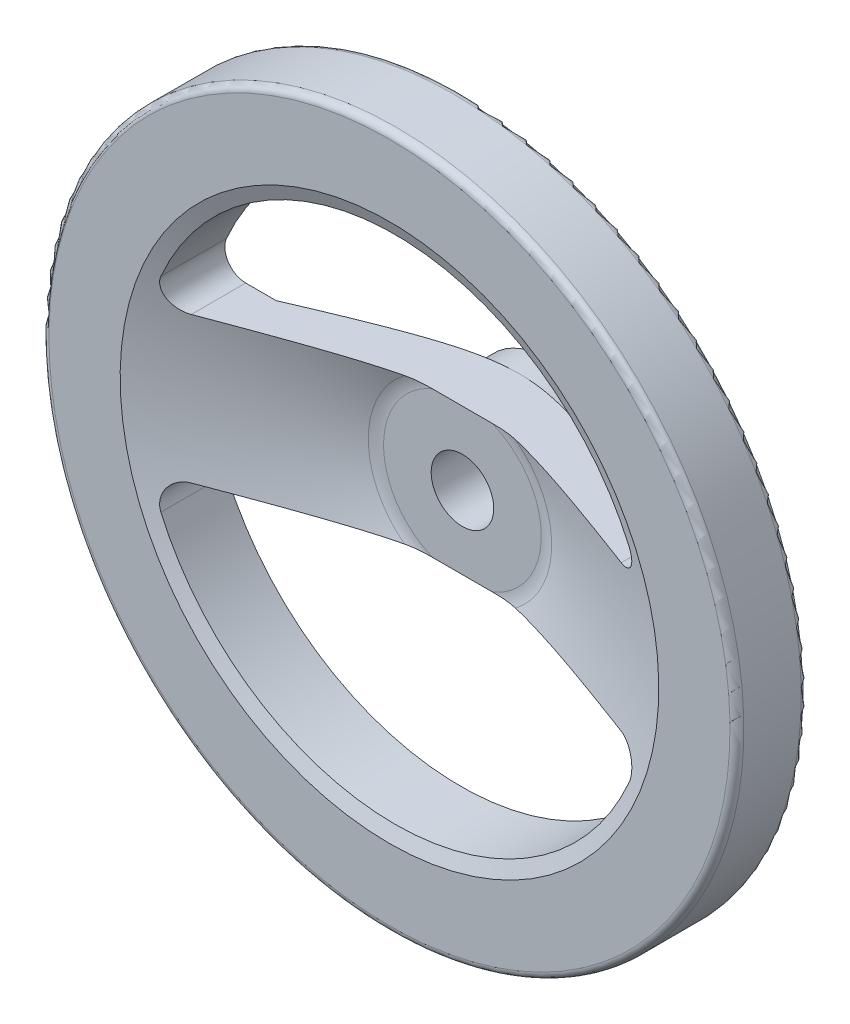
ISO-10303-21;
HEADER;
FILE_DESCRIPTION(('STEP AP214'),'2;1');
FILE_NAME('part.step','',(''),(''),'','','');
FILE_SCHEMA(('AUTOMOTIVE_DESIGN { 1 0 10303 214 1 1 1 1 }'));
ENDSEC;
DATA;
#1=APPLICATION_CONTEXT('core data for automotive mechanical design processes');
#2=APPLICATION_PROTOCOL_DEFINITION('international standard','automotive_design',2000,#1);
#3=PRODUCT_CONTEXT('',#1,'mechanical');
#4=PRODUCT('Part','Part','',(#3));
#5=PRODUCT_RELATED_PRODUCT_CATEGORY('part','',(#4));
#6=PRODUCT_DEFINITION_FORMATION('','',#4);
#7=PRODUCT_DEFINITION_CONTEXT('part definition',#1,'design');
#8=PRODUCT_DEFINITION('design','',#6,#7);
#9=PRODUCT_DEFINITION_SHAPE('','',#8);
#10=(LENGTH_UNIT() NAMED_UNIT(*) SI_UNIT(.MILLI.,.METRE.));
#11=(NAMED_UNIT(*) PLANE_ANGLE_UNIT() SI_UNIT($,.RADIAN.));
#12=(NAMED_UNIT(*) SI_UNIT($,.STERADIAN.) SOLID_ANGLE_UNIT());
#13=UNCERTAINTY_MEASURE_WITH_UNIT(LENGTH_MEASURE(1.E-05),#10,'distance_accuracy_value','');
#14=(GEOMETRIC_REPRESENTATION_CONTEXT(3) GLOBAL_UNCERTAINTY_ASSIGNED_CONTEXT((#13)) GLOBAL_UNIT_ASSIGNED_CONTEXT((#10,
#11,#12)) REPRESENTATION_CONTEXT('',''));
#15=CARTESIAN_POINT('',(0.,0.,0.));
#16=DIRECTION('',(0.,0.,1.));
#17=DIRECTION('',(1.,0.,0.));
#18=AXIS2_PLACEMENT_3D('',#15,#16,#17);
#19=CARTESIAN_POINT('',(-21.325127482,21.252,0.));
#20=DIRECTION('',(0.,0.,1.));
#21=DIRECTION('',(0.,-1.,0.));
#22=AXIS2_PLACEMENT_3D('',#19,#20,#21);
#23=PLANE('',#22);
#24=CARTESIAN_POINT('',(0.,0.,0.));
#25=DIRECTION('',(0.,0.,1.));
#26=DIRECTION('',(0.,-1.,0.));
#27=AXIS2_PLACEMENT_3D('',#24,#25,#26);
#28=CIRCLE('',#27,9.);
#29=CARTESIAN_POINT('',(0.,-9.,0.));
#30=VERTEX_POINT('',#29);
#31=EDGE_CURVE('E18',#30,#30,#28,.T.);
#32=ORIENTED_EDGE('',*,*,#31,.T.);
#33=EDGE_LOOP('',(#32));
#34=FACE_BOUND('',#33,.T.);
#35=CARTESIAN_POINT('',(0.,0.,0.));
#36=DIRECTION('',(0.,0.,-1.));
#37=DIRECTION('',(-1.,0.,0.));
#38=AXIS2_PLACEMENT_3D('',#35,#36,#37);
#39=CIRCLE('',#38,21.);
#40=CARTESIAN_POINT('',(-21.,0.,0.));
#41=VERTEX_POINT('',#40);
#42=EDGE_CURVE('E401',#41,#41,#39,.F.);
#43=ORIENTED_EDGE('',*,*,#42,.F.);
#44=EDGE_LOOP('',(#43));
#45=FACE_BOUND('',#44,.T.);
#46=ADVANCED_FACE('F14',(#34,#45),#23,.F.);
#47=CARTESIAN_POINT('',(0.,0.,0.));
#48=DIRECTION('',(0.,0.,1.));
#49=DIRECTION('',(0.,-1.,0.));
#50=AXIS2_PLACEMENT_3D('',#47,#48,#49);
#51=CYLINDRICAL_SURFACE('',#50,9.);
#52=CARTESIAN_POINT('',(0.,0.,24.));
#53=DIRECTION('',(0.,0.,1.));
#54=DIRECTION('',(0.,-1.,0.));
#55=AXIS2_PLACEMENT_3D('',#52,#53,#54);
#56=CIRCLE('',#55,9.);
#57=CARTESIAN_POINT('',(0.,-9.,24.));
#58=VERTEX_POINT('',#57);
#59=EDGE_CURVE('E397',#58,#58,#56,.T.);
#60=ORIENTED_EDGE('',*,*,#59,.T.);
#61=EDGE_LOOP('',(#60));
#62=FACE_BOUND('',#61,.T.);
#63=ORIENTED_EDGE('',*,*,#31,.F.);
#64=EDGE_LOOP('',(#63));
#65=FACE_BOUND('',#64,.T.);
#66=ADVANCED_FACE('F529',(#62,#65),#51,.F.);
#67=CARTESIAN_POINT('',(0.,0.,43.));
#68=DIRECTION('',(0.,0.,-1.));
#69=DIRECTION('',(0.,1.,0.));
#70=AXIS2_PLACEMENT_3D('',#67,#68,#69);
#71=TOROIDAL_SURFACE('',#70,98.,2.);
#72=CARTESIAN_POINT('',(0.,0.,43.));
#73=DIRECTION('',(0.,0.,-1.));
#74=DIRECTION('',(0.,1.,0.));
#75=AXIS2_PLACEMENT_3D('',#72,#73,#74);
#76=CIRCLE('',#75,100.);
#77=CARTESIAN_POINT('',(0.,100.,43.));
#78=VERTEX_POINT('',#77);
#79=EDGE_CURVE('E403',#78,#78,#76,.T.);
#80=ORIENTED_EDGE('',*,*,#79,.F.);
#81=EDGE_LOOP('',(#80));
#82=FACE_BOUND('',#81,.T.);
#83=CARTESIAN_POINT('',(0.,0.,45.));
#84=DIRECTION('',(0.,0.,-1.));
#85=DIRECTION('',(0.,1.,0.));
#86=AXIS2_PLACEMENT_3D('',#83,#84,#85);
#87=CIRCLE('',#86,97.999999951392);
#88=CARTESIAN_POINT('',(0.,97.999999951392,45.));
#89=VERTEX_POINT('',#88);
#90=EDGE_CURVE('E137',#89,#89,#87,.T.);
#91=ORIENTED_EDGE('',*,*,#90,.T.);
#92=EDGE_LOOP('',(#91));
#93=FACE_BOUND('',#92,.T.);
#94=ADVANCED_FACE('F376',(#82,#93),#71,.T.);
#95=CARTESIAN_POINT('',(0.,0.,43.));
#96=DIRECTION('',(0.,0.,-1.));
#97=DIRECTION('',(-1.,0.,0.));
#98=AXIS2_PLACEMENT_3D('',#95,#96,#97);
#99=CYLINDRICAL_SURFACE('',#98,100.);
#100=CARTESIAN_POINT('',(0.,0.,26.5));
#101=DIRECTION('',(0.,0.,-1.));
#102=DIRECTION('',(0.,1.,0.));
#103=AXIS2_PLACEMENT_3D('',#100,#101,#102);
#104=CIRCLE('',#103,100.);
#105=CARTESIAN_POINT('',(0.,100.,26.5));
#106=VERTEX_POINT('',#105);
#107=EDGE_CURVE('E468',#106,#106,#104,.T.);
#108=ORIENTED_EDGE('',*,*,#107,.F.);
#109=EDGE_LOOP('',(#108));
#110=FACE_BOUND('',#109,.T.);
#111=ORIENTED_EDGE('',*,*,#79,.T.);
#112=EDGE_LOOP('',(#111));
#113=FACE_BOUND('',#112,.T.);
#114=ADVANCED_FACE('F521',(#110,#113),#99,.T.);
#115=CARTESIAN_POINT('',(0.,0.,7.741662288));
#116=DIRECTION('',(0.,0.,-1.));
#117=DIRECTION('',(-1.,0.,0.));
#118=AXIS2_PLACEMENT_3D('',#115,#116,#117);
#119=CYLINDRICAL_SURFACE('',#118,21.);
#120=ORIENTED_EDGE('',*,*,#42,.T.);
#121=EDGE_LOOP('',(#120));
#122=FACE_BOUND('',#121,.T.);
#123=CARTESIAN_POINT('',(0.,0.,7.741662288));
#124=DIRECTION('',(0.,0.,1.));
#125=DIRECTION('',(0.,-1.,0.));
#126=AXIS2_PLACEMENT_3D('',#123,#124,#125);
#127=CIRCLE('',#126,21.);
#128=CARTESIAN_POINT('',(-4.30717199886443E-09,-21.,7.741662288));
#129=VERTEX_POINT('',#128);
#130=CARTESIAN_POINT('',(-4.30717199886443E-09,21.,7.741662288));
#131=VERTEX_POINT('',#130);
#132=EDGE_CURVE('E471',#129,#131,#127,.T.);
#133=ORIENTED_EDGE('',*,*,#132,.F.);
#134=CARTESIAN_POINT('',(0.,0.,7.741662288));
#135=DIRECTION('',(0.,0.,1.));
#136=DIRECTION('',(0.,-1.,0.));
#137=AXIS2_PLACEMENT_3D('',#134,#135,#136);
#138=CIRCLE('',#137,21.);
#139=EDGE_CURVE('E469',#131,#129,#138,.T.);
#140=ORIENTED_EDGE('',*,*,#139,.F.);
#141=EDGE_LOOP('',(#133,#140));
#142=FACE_BOUND('',#141,.T.);
#143=ADVANCED_FACE('F425',(#122,#142),#119,.T.);
#144=CARTESIAN_POINT('',(-8.31647613,-21.120028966,24.));
#145=CARTESIAN_POINT('',(-30.998387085,-12.188527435,24.));
#146=CARTESIAN_POINT('',(-30.998387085,12.188527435,24.));
#147=CARTESIAN_POINT('',(-8.31647613,21.120028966,24.));
#148=CARTESIAN_POINT('',(-8.78085762,-22.299344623,24.));
#149=CARTESIAN_POINT('',(-32.729297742,-12.869119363,24.));
#150=CARTESIAN_POINT('',(-32.729297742,12.869119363,24.));
#151=CARTESIAN_POINT('',(-8.78085762,22.299344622,24.));
#152=CARTESIAN_POINT('',(-9.23697106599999,-23.457663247,24.238105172));
#153=CARTESIAN_POINT('',(-34.429390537,-13.537593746,24.238105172));
#154=CARTESIAN_POINT('',(-34.429390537,13.537593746,24.238105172));
#155=CARTESIAN_POINT('',(-9.23697106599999,23.457663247,24.238105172));
#156=CARTESIAN_POINT('',(-9.668574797,-24.553738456,24.705836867));
#157=CARTESIAN_POINT('',(-36.038127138,-14.170146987,24.705836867));
#158=CARTESIAN_POINT('',(-36.038127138,14.170146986,24.705836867));
#159=CARTESIAN_POINT('',(-9.668574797,24.553738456,24.705836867));
#160=(BOUNDED_SURFACE() B_SPLINE_SURFACE(3,3,((#144,#145,#146,#147),(#148,#149,#150,#151),(#152,
#153,#154,#155),(#156,#157,#158,#159)),.UNSPECIFIED.,.F.,.F.,
.F.) B_SPLINE_SURFACE_WITH_KNOTS((4,4),(4,4),(0.,1.),(0.,1.),
.UNSPECIFIED.) GEOMETRIC_REPRESENTATION_ITEM() RATIONAL_B_SPLINE_SURFACE(((1.,0.5775931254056,
0.5775931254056,1.),(0.988130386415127,0.570737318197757,0.570737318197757,0.988130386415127),
(0.988130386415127,0.570737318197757,0.570737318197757,0.988130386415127),(1.,0.5775931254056,
0.5775931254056,1.))) REPRESENTATION_ITEM('') SURFACE());
#161=CARTESIAN_POINT('',(-15.980219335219,-21.,24.7058368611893));
#162=CARTESIAN_POINT('',(-15.5264060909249,-21.,24.5967564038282));
#163=CARTESIAN_POINT('',(-15.0690436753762,-21.,24.5037933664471));
#164=CARTESIAN_POINT('',(-14.1501863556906,-21.,24.34576330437));
#165=CARTESIAN_POINT('',(-13.6886987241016,-21.,24.2806544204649));
#166=CARTESIAN_POINT('',(-12.8443331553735,-21.,24.1830712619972));
#167=CARTESIAN_POINT('',(-12.4618630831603,-21.,24.1468761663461));
#168=CARTESIAN_POINT('',(-11.6957145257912,-21.,24.0878312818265));
#169=CARTESIAN_POINT('',(-11.3120355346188,-21.,24.0649881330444));
#170=CARTESIAN_POINT('',(-10.5427235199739,-21.,24.0302005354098));
#171=CARTESIAN_POINT('',(-10.1570886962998,-21.,24.0182987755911));
#172=CARTESIAN_POINT('',(-9.38597399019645,-21.,24.0032102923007));
#173=CARTESIAN_POINT('',(-9.00049426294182,-21.,24.0000160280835));
#174=CARTESIAN_POINT('',(-8.61506813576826,-21.,24.));
#175=B_SPLINE_CURVE_WITH_KNOTS('',3,(#161,#162,#163,#164,#165,#166,#167,#168,#169,#170,#171,
#172,#173,#174),.UNSPECIFIED.,.F.,.F.,(4,2,2,2,2,2,4),(0.,1.39947637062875,2.79684215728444,
3.94913910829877,5.1020086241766,6.25935733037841,7.41570344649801),.UNSPECIFIED.);
#176=CARTESIAN_POINT('',(-15.9802193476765,-21.,24.7058368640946));
#177=VERTEX_POINT('',#176);
#178=CARTESIAN_POINT('',(-8.61506813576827,-20.999999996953,23.9999999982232));
#179=VERTEX_POINT('',#178);
#180=EDGE_CURVE('E441',#177,#179,#175,.T.);
#181=CARTESIAN_POINT('',(-8.31647613,-21.120028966,24.));
#182=CARTESIAN_POINT('',(-30.998387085,-12.188527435,24.));
#183=CARTESIAN_POINT('',(-30.998387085,12.188527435,24.));
#184=CARTESIAN_POINT('',(-8.31647613,21.120028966,24.));
#185=(BOUNDED_CURVE() B_SPLINE_CURVE(3,(#181,#182,#183,#184),.UNSPECIFIED.,.F.,
.F.) B_SPLINE_CURVE_WITH_KNOTS((4,4),(0.,1.),
.UNSPECIFIED.) CURVE() GEOMETRIC_REPRESENTATION_ITEM() RATIONAL_B_SPLINE_CURVE((1.,
0.5775931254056,0.5775931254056,1.)) REPRESENTATION_ITEM(''));
#186=CARTESIAN_POINT('',(-8.61506813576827,20.999999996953,23.9999999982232));
#187=VERTEX_POINT('',#186);
#188=EDGE_CURVE('E399',#179,#187,#185,.T.);
#189=CARTESIAN_POINT('',(-8.61506813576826,21.,24.));
#190=CARTESIAN_POINT('',(-9.07992215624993,21.,24.0000321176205));
#191=CARTESIAN_POINT('',(-9.54491034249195,21.,24.0046700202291));
#192=CARTESIAN_POINT('',(-10.4750693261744,21.,24.0273072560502));
#193=CARTESIAN_POINT('',(-10.9402397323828,21.,24.0453217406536));
#194=CARTESIAN_POINT('',(-11.788406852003,21.,24.0942005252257));
#195=CARTESIAN_POINT('',(-12.1715567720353,21.,24.1222688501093));
#196=CARTESIAN_POINT('',(-12.936337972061,21.,24.1927560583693));
#197=CARTESIAN_POINT('',(-13.3179699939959,21.,24.235166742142));
#198=CARTESIAN_POINT('',(-14.0817167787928,21.,24.3371611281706));
#199=CARTESIAN_POINT('',(-14.4638161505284,21.,24.396863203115));
#200=CARTESIAN_POINT('',(-15.2248538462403,21.,24.5359423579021));
#201=CARTESIAN_POINT('',(-15.6037879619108,21.,24.6153423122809));
#202=CARTESIAN_POINT('',(-15.9802193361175,21.,24.7058368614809));
#203=B_SPLINE_CURVE_WITH_KNOTS('',3,(#189,#190,#191,#192,#193,#194,#195,#196,#197,#198,#199,
#200,#201,#202),.UNSPECIFIED.,.F.,.F.,(4,2,2,2,2,2,4),(0.,1.39474962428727,2.79108146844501,
3.94337869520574,5.09501825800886,6.25473594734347,7.41580673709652),.UNSPECIFIED.);
#204=CARTESIAN_POINT('',(-15.9802193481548,21.,24.7058368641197));
#205=VERTEX_POINT('',#204);
#206=EDGE_CURVE('E148',#187,#205,#203,.T.);
#207=CARTESIAN_POINT('',(0.,0.,24.705836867));
#208=DIRECTION('',(0.,0.,1.));
#209=DIRECTION('',(0.,-1.,0.));
#210=AXIS2_PLACEMENT_3D('',#207,#208,#209);
#211=CIRCLE('',#210,26.388774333);
#212=EDGE_CURVE('E136',#205,#177,#211,.T.);
#213=ORIENTED_EDGE('',*,*,#180,.T.);
#214=ORIENTED_EDGE('',*,*,#188,.T.);
#215=ORIENTED_EDGE('',*,*,#206,.T.);
#216=ORIENTED_EDGE('',*,*,#212,.T.);
#217=EDGE_LOOP('',(#213,#214,#215,#216));
#218=FACE_BOUND('',#217,.T.);
#219=ADVANCED_FACE('F374',(#218),#160,.F.);
#220=CARTESIAN_POINT('',(-23.023196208,-21.,24.));
#221=DIRECTION('',(0.,0.,-1.));
#222=DIRECTION('',(0.,1.,0.));
#223=AXIS2_PLACEMENT_3D('',#220,#221,#222);
#224=PLANE('',#223);
#225=ORIENTED_EDGE('',*,*,#59,.F.);
#226=EDGE_LOOP('',(#225));
#227=FACE_BOUND('',#226,.T.);
#228=DIRECTION('',(1.,0.,0.));
#229=VECTOR('',#228,1.);
#230=CARTESIAN_POINT('',(0.,-21.,23.999999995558));
#231=LINE('',#230,#229);
#232=CARTESIAN_POINT('',(8.61506813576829,-20.999999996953,23.9999999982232));
#233=VERTEX_POINT('',#232);
#234=EDGE_CURVE('E131',#179,#233,#231,.T.);
#235=ORIENTED_EDGE('',*,*,#234,.T.);
#236=CARTESIAN_POINT('',(8.31647613,21.120028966,24.));
#237=CARTESIAN_POINT('',(30.998387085,12.188527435,24.));
#238=CARTESIAN_POINT('',(30.998387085,-12.188527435,24.));
#239=CARTESIAN_POINT('',(8.31647613,-21.120028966,24.));
#240=(BOUNDED_CURVE() B_SPLINE_CURVE(3,(#236,#237,#238,#239),.UNSPECIFIED.,.F.,
.F.) B_SPLINE_CURVE_WITH_KNOTS((4,4),(0.,1.),
.UNSPECIFIED.) CURVE() GEOMETRIC_REPRESENTATION_ITEM() RATIONAL_B_SPLINE_CURVE((1.,
0.5775931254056,0.5775931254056,1.)) REPRESENTATION_ITEM(''));
#241=CARTESIAN_POINT('',(8.61506813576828,20.999999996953,23.9999999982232));
#242=VERTEX_POINT('',#241);
#243=EDGE_CURVE('E125',#233,#242,#240,.F.);
#244=ORIENTED_EDGE('',*,*,#243,.T.);
#245=DIRECTION('',(-1.,0.,0.));
#246=VECTOR('',#245,1.);
#247=CARTESIAN_POINT('',(0.,21.,23.999999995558));
#248=LINE('',#247,#246);
#249=EDGE_CURVE('E129',#242,#187,#248,.T.);
#250=ORIENTED_EDGE('',*,*,#249,.T.);
#251=ORIENTED_EDGE('',*,*,#188,.F.);
#252=EDGE_LOOP('',(#235,#244,#250,#251));
#253=FACE_BOUND('',#252,.T.);
#254=ADVANCED_FACE('F128',(#227,#253),#224,.F.);
#255=CARTESIAN_POINT('',(-99.517261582,-99.176,45.));
#256=DIRECTION('',(0.,0.,-1.));
#257=DIRECTION('',(0.,1.,0.));
#258=AXIS2_PLACEMENT_3D('',#255,#256,#257);
#259=PLANE('',#258);
#260=CARTESIAN_POINT('',(0.,0.,45.));
#261=DIRECTION('',(0.,0.,1.));
#262=DIRECTION('',(0.,-1.,0.));
#263=AXIS2_PLACEMENT_3D('',#260,#261,#262);
#264=CIRCLE('',#263,77.5);
#265=CARTESIAN_POINT('',(0.,-77.5,45.));
#266=VERTEX_POINT('',#265);
#267=EDGE_CURVE('E393',#266,#266,#264,.F.);
#268=ORIENTED_EDGE('',*,*,#267,.T.);
#269=EDGE_LOOP('',(#268));
#270=FACE_BOUND('',#269,.T.);
#271=ORIENTED_EDGE('',*,*,#90,.F.);
#272=EDGE_LOOP('',(#271));
#273=FACE_BOUND('',#272,.T.);
#274=ADVANCED_FACE('F373',(#270,#273),#259,.F.);
#275=CARTESIAN_POINT('',(8.31647613,21.120028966,24.));
#276=CARTESIAN_POINT('',(30.998387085,12.188527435,24.));
#277=CARTESIAN_POINT('',(30.998387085,-12.188527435,24.));
#278=CARTESIAN_POINT('',(8.31647613,-21.120028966,24.));
#279=CARTESIAN_POINT('',(8.78085762,22.299344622,24.));
#280=CARTESIAN_POINT('',(32.729297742,12.869119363,24.));
#281=CARTESIAN_POINT('',(32.729297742,-12.869119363,24.));
#282=CARTESIAN_POINT('',(8.78085762,-22.299344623,24.));
#283=CARTESIAN_POINT('',(9.23697106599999,23.457663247,24.238105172));
#284=CARTESIAN_POINT('',(34.429390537,13.537593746,24.238105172));
#285=CARTESIAN_POINT('',(34.429390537,-13.537593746,24.238105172));
#286=CARTESIAN_POINT('',(9.23697106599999,-23.457663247,24.238105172));
#287=CARTESIAN_POINT('',(9.668574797,24.553738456,24.705836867));
#288=CARTESIAN_POINT('',(36.038127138,14.170146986,24.705836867));
#289=CARTESIAN_POINT('',(36.038127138,-14.170146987,24.705836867));
#290=CARTESIAN_POINT('',(9.668574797,-24.553738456,24.705836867));
#291=(BOUNDED_SURFACE() B_SPLINE_SURFACE(3,3,((#275,#276,#277,#278),(#279,#280,#281,#282),(#283,
#284,#285,#286),(#287,#288,#289,#290)),.UNSPECIFIED.,.F.,.F.,
.F.) B_SPLINE_SURFACE_WITH_KNOTS((4,4),(4,4),(0.,1.),(0.,1.),
.UNSPECIFIED.) GEOMETRIC_REPRESENTATION_ITEM() RATIONAL_B_SPLINE_SURFACE(((1.,0.5775931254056,
0.5775931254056,1.),(0.988130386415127,0.570737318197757,0.570737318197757,0.988130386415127),
(0.988130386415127,0.570737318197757,0.570737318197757,0.988130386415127),(1.,0.5775931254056,
0.5775931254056,1.))) REPRESENTATION_ITEM('') SURFACE());
#292=CARTESIAN_POINT('',(8.61506813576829,-21.,24.));
#293=CARTESIAN_POINT('',(9.07992215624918,-21.,24.0000321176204));
#294=CARTESIAN_POINT('',(9.54491034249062,-21.,24.0046700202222));
#295=CARTESIAN_POINT('',(10.4750693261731,-21.,24.0273072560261));
#296=CARTESIAN_POINT('',(10.9402397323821,-21.,24.045321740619));
#297=CARTESIAN_POINT('',(11.7884068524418,-21.,24.0942005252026));
#298=CARTESIAN_POINT('',(12.1715567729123,-21.,24.1222688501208));
#299=CARTESIAN_POINT('',(12.9363379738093,-21.,24.1927560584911));
#300=CARTESIAN_POINT('',(13.3179699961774,-21.,24.2351667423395));
#301=CARTESIAN_POINT('',(14.0817167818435,-21.,24.337161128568));
#302=CARTESIAN_POINT('',(14.463816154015,-21.,24.3968632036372));
#303=CARTESIAN_POINT('',(15.224853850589,-21.,24.535942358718));
#304=CARTESIAN_POINT('',(15.6037879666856,-21.,24.6153423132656));
#305=CARTESIAN_POINT('',(15.9802193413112,-21.,24.7058368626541));
#306=B_SPLINE_CURVE_WITH_KNOTS('',3,(#292,#293,#294,#295,#296,#297,#298,#299,#300,#301,#302,
#303,#304,#305),.UNSPECIFIED.,.F.,.F.,(4,2,2,2,2,2,4),(0.,1.3947496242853,2.79108146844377,
3.94337869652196,5.09501826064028,6.25473595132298,7.41580674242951),.UNSPECIFIED.);
#307=CARTESIAN_POINT('',(15.9802193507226,-21.,24.705836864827));
#308=VERTEX_POINT('',#307);
#309=EDGE_CURVE('E450',#233,#308,#306,.T.);
#310=CARTESIAN_POINT('',(0.,0.,24.705836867));
#311=DIRECTION('',(0.,0.,1.));
#312=DIRECTION('',(0.,-1.,0.));
#313=AXIS2_PLACEMENT_3D('',#310,#311,#312);
#314=CIRCLE('',#313,26.388774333);
#315=CARTESIAN_POINT('',(15.9802193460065,21.,24.705836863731));
#316=VERTEX_POINT('',#315);
#317=EDGE_CURVE('E153',#308,#316,#314,.T.);
#318=CARTESIAN_POINT('',(15.9802193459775,21.,24.7058368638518));
#319=CARTESIAN_POINT('',(15.5264061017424,21.,24.5967564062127));
#320=CARTESIAN_POINT('',(15.0690436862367,21.,24.5037933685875));
#321=CARTESIAN_POINT('',(14.1501863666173,21.,24.3457633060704));
#322=CARTESIAN_POINT('',(13.6886987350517,21.,24.2806544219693));
#323=CARTESIAN_POINT('',(12.8443331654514,21.,24.1830712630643));
#324=CARTESIAN_POINT('',(12.4618630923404,21.,24.1468761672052));
#325=CARTESIAN_POINT('',(11.6957145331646,21.,24.0878312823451));
#326=CARTESIAN_POINT('',(11.3120355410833,21.,24.0649881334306));
#327=CARTESIAN_POINT('',(10.5427235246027,21.,24.0302005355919));
#328=CARTESIAN_POINT('',(10.1570887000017,21.,24.0182987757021));
#329=CARTESIAN_POINT('',(9.38597399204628,21.,24.0032102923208));
#330=CARTESIAN_POINT('',(9.00049426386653,21.,24.0000160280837));
#331=CARTESIAN_POINT('',(8.61506813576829,21.,24.));
#332=B_SPLINE_CURVE_WITH_KNOTS('',3,(#318,#319,#320,#321,#322,#323,#324,#325,#326,#327,#328,
#329,#330,#331),.UNSPECIFIED.,.F.,.F.,(4,2,2,2,2,2,4),(0.,1.39947637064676,2.79684215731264,
3.9491391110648,5.10200862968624,6.25935733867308,7.41570345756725),.UNSPECIFIED.);
#333=EDGE_CURVE('E145',#316,#242,#332,.T.);
#334=ORIENTED_EDGE('',*,*,#309,.T.);
#335=ORIENTED_EDGE('',*,*,#317,.T.);
#336=ORIENTED_EDGE('',*,*,#333,.T.);
#337=ORIENTED_EDGE('',*,*,#243,.F.);
#338=EDGE_LOOP('',(#334,#335,#336,#337));
#339=FACE_BOUND('',#338,.T.);
#340=ADVANCED_FACE('F151',(#339),#291,.F.);
#341=CARTESIAN_POINT('',(0.,0.,26.5));
#342=DIRECTION('',(0.,0.,-1.));
#343=DIRECTION('',(-1.,0.,0.));
#344=AXIS2_PLACEMENT_3D('',#341,#342,#343);
#345=TOROIDAL_SURFACE('',#344,98.,2.);
#346=CARTESIAN_POINT('',(0.,0.,24.5));
#347=DIRECTION('',(0.,0.,-1.));
#348=DIRECTION('',(-1.,0.,0.));
#349=AXIS2_PLACEMENT_3D('',#346,#347,#348);
#350=CIRCLE('',#349,97.999999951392);
#351=CARTESIAN_POINT('',(-97.999999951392,0.,24.5));
#352=VERTEX_POINT('',#351);
#353=EDGE_CURVE('E276',#352,#352,#350,.F.);
#354=ORIENTED_EDGE('',*,*,#353,.T.);
#355=EDGE_LOOP('',(#354));
#356=FACE_BOUND('',#355,.T.);
#357=ORIENTED_EDGE('',*,*,#107,.T.);
#358=EDGE_LOOP('',(#357));
#359=FACE_BOUND('',#358,.T.);
#360=ADVANCED_FACE('F190',(#356,#359),#345,.T.);
#361=CARTESIAN_POINT('',(-61.864771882,-27.,24.5));
#362=DIRECTION('',(0.,0.,1.));
#363=DIRECTION('',(1.,0.,0.));
#364=AXIS2_PLACEMENT_3D('',#361,#362,#363);
#365=CYLINDRICAL_SURFACE('',#364,6.);
#366=CARTESIAN_POINT('',(-67.3638627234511,-29.3999999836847,43.4117647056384));
#367=CARTESIAN_POINT('',(-67.428376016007,-29.2522386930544,43.4117718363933));
#368=CARTESIAN_POINT('',(-67.4868895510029,-29.1018655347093,43.4093952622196));
#369=CARTESIAN_POINT('',(-67.5915919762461,-28.797058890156,43.3999269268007));
#370=CARTESIAN_POINT('',(-67.6377828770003,-28.6426260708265,43.3928359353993));
#371=CARTESIAN_POINT('',(-67.717445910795,-28.3311674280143,43.3740122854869));
#372=CARTESIAN_POINT('',(-67.750946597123,-28.174148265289,43.3622901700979));
#373=CARTESIAN_POINT('',(-67.8052216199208,-27.858326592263,43.3343030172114));
#374=CARTESIAN_POINT('',(-67.825995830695,-27.6995240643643,43.3180379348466));
#375=CARTESIAN_POINT('',(-67.8547720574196,-27.3813283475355,43.2811015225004));
#376=CARTESIAN_POINT('',(-67.8627779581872,-27.2219353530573,43.2604315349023));
#377=CARTESIAN_POINT('',(-67.8661094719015,-26.9035699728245,43.2148366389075));
#378=CARTESIAN_POINT('',(-67.8614303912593,-26.7445977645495,43.189910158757));
#379=CARTESIAN_POINT('',(-67.8395714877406,-26.4282440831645,43.1360024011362));
#380=CARTESIAN_POINT('',(-67.8223940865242,-26.2708623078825,43.1070219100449));
#381=CARTESIAN_POINT('',(-67.7758184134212,-25.9586286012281,43.0452032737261));
#382=CARTESIAN_POINT('',(-67.7464155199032,-25.8037776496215,43.0123636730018));
#383=CARTESIAN_POINT('',(-67.6749218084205,-25.494005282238,42.9422444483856));
#384=CARTESIAN_POINT('',(-67.6325469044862,-25.3391691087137,42.9048780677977));
#385=CARTESIAN_POINT('',(-67.5358390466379,-25.0341396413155,42.8266023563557));
#386=CARTESIAN_POINT('',(-67.4815017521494,-24.8839480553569,42.7856917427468));
#387=CARTESIAN_POINT('',(-67.361426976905,-24.5891684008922,42.7006171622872));
#388=CARTESIAN_POINT('',(-67.2956904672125,-24.444579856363,42.65645347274));
#389=CARTESIAN_POINT('',(-67.1533855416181,-24.161754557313,42.5651359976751));
#390=CARTESIAN_POINT('',(-67.0768130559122,-24.0235202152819,42.5179810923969));
#391=CARTESIAN_POINT('',(-66.9088241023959,-23.7465015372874,42.4182117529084));
#392=CARTESIAN_POINT('',(-66.8168097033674,-23.6081364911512,42.3654393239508));
#393=CARTESIAN_POINT('',(-66.6221622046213,-23.3401257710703,42.2572150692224));
#394=CARTESIAN_POINT('',(-66.5195251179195,-23.2104834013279,42.2017622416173));
#395=CARTESIAN_POINT('',(-66.3045011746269,-22.9606988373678,42.0885539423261));
#396=CARTESIAN_POINT('',(-66.1921166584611,-22.8405543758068,42.0307990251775));
#397=CARTESIAN_POINT('',(-65.9583703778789,-22.6103103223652,41.9133007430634));
#398=CARTESIAN_POINT('',(-65.837005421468,-22.5002143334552,41.8535566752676));
#399=CARTESIAN_POINT('',(-65.5784222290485,-22.2841852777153,41.7287021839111));
#400=CARTESIAN_POINT('',(-65.4406878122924,-22.1789293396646,41.6634882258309));
#401=CARTESIAN_POINT('',(-65.1571001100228,-21.9809882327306,41.5316449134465));
#402=CARTESIAN_POINT('',(-65.0112464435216,-21.8883036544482,41.4650154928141));
#403=CARTESIAN_POINT('',(-64.712372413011,-21.7159730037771,41.3307281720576));
#404=CARTESIAN_POINT('',(-64.5593485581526,-21.6363333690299,41.263069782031));
#405=CARTESIAN_POINT('',(-64.2472805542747,-21.4906171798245,41.1272019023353));
#406=CARTESIAN_POINT('',(-64.0882383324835,-21.4245363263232,41.0589925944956));
#407=CARTESIAN_POINT('',(-63.7623217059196,-21.305271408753,40.9212471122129));
#408=CARTESIAN_POINT('',(-63.5953593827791,-21.2523303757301,40.8517084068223));
#409=CARTESIAN_POINT('',(-63.2573270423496,-21.1612128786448,40.7129441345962));
#410=CARTESIAN_POINT('',(-63.0862570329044,-21.1230363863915,40.643718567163));
#411=CARTESIAN_POINT('',(-62.741108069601,-21.0617553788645,40.5060472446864));
#412=CARTESIAN_POINT('',(-62.5670288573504,-21.0386521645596,40.4376015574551));
#413=CARTESIAN_POINT('',(-62.2170067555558,-21.0077690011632,40.3019835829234));
#414=CARTESIAN_POINT('',(-62.0410636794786,-20.9999906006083,40.2348114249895));
#415=CARTESIAN_POINT('',(-61.8647718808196,-21.,40.1685267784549));
#416=B_SPLINE_CURVE_WITH_KNOTS('',3,(#366,#367,#368,#369,#370,#371,#372,#373,#374,#375,#376,
#377,#378,#379,#380,#381,#382,#383,#384,#385,#386,#387,#388,#389,#390,#391,#392,#393,#394,#395,
#396,#397,#398,#399,#400,#401,#402,#403,#404,#405,#406,#407,#408,#409,#410,#411,#412,#413,#414,
#415),.UNSPECIFIED.,.F.,.F.,(4,2,2,2,2,2,2,2,2,2,2,2,2,2,2,2,2,2,2,2,2,2,2,2,4),(0.,
0.483533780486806,0.966988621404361,1.44934912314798,1.93171438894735,2.41393286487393,
2.89632979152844,3.3786332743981,3.86111924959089,4.35503576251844,4.84913179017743,
5.34318574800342,5.8374257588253,6.35988667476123,6.88254440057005,7.40507697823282,
7.92779618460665,8.48280111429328,9.03783210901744,9.59313619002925,10.1482639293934,
10.7130004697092,11.2777359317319,11.8425201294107,12.4073613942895),.UNSPECIFIED.);
#417=CARTESIAN_POINT('',(-67.363862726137,-29.3999999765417,43.4117647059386));
#418=VERTEX_POINT('',#417);
#419=CARTESIAN_POINT('',(-61.8647718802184,-21.,40.1685267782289));
#420=VERTEX_POINT('',#419);
#421=EDGE_CURVE('E261',#418,#420,#416,.T.);
#422=ORIENTED_EDGE('',*,*,#421,.F.);
#423=DIRECTION('',(0.,0.,-1.));
#424=VECTOR('',#423,1.);
#425=CARTESIAN_POINT('',(-67.3638627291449,-29.3999999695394,33.955882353));
#426=LINE('',#425,#424);
#427=CARTESIAN_POINT('',(-67.3638627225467,-29.3999999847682,24.5));
#428=VERTEX_POINT('',#427);
#429=EDGE_CURVE('E322',#418,#428,#426,.T.);
#430=ORIENTED_EDGE('',*,*,#429,.T.);
#431=CARTESIAN_POINT('',(-61.864771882,-27.,24.5));
#432=DIRECTION('',(0.,0.,1.));
#433=DIRECTION('',(1.,0.,0.));
#434=AXIS2_PLACEMENT_3D('',#431,#432,#433);
#435=CIRCLE('',#434,6.);
#436=CARTESIAN_POINT('',(-61.864771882,-20.999999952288,24.5));
#437=VERTEX_POINT('',#436);
#438=EDGE_CURVE('E331',#428,#437,#435,.F.);
#439=ORIENTED_EDGE('',*,*,#438,.T.);
#440=DIRECTION('',(0.,0.,1.));
#441=VECTOR('',#440,1.);
#442=CARTESIAN_POINT('',(-61.864771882,-21.,23.9550945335));
#443=LINE('',#442,#441);
#444=EDGE_CURVE('E298',#437,#420,#443,.T.);
#445=ORIENTED_EDGE('',*,*,#444,.T.);
#446=EDGE_LOOP('',(#422,#430,#439,#445));
#447=FACE_BOUND('',#446,.T.);
#448=ADVANCED_FACE('F303',(#447),#365,.F.);
#449=CARTESIAN_POINT('',(0.,0.,7.741662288));
#450=DIRECTION('',(0.,0.,1.));
#451=DIRECTION('',(1.,0.,0.));
#452=AXIS2_PLACEMENT_3D('',#449,#450,#451);
#453=CONICAL_SURFACE('',#452,21.,1.13587104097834);
#454=CARTESIAN_POINT('',(0.,0.,24.5));
#455=DIRECTION('',(0.,0.,1.));
#456=DIRECTION('',(1.,0.,0.));
#457=AXIS2_PLACEMENT_3D('',#454,#455,#456);
#458=CIRCLE('',#457,57.070789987);
#459=CARTESIAN_POINT('',(-53.0667039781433,-20.999999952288,24.4999999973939));
#460=VERTEX_POINT('',#459);
#461=CARTESIAN_POINT('',(-53.0667039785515,20.999999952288,24.4999999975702));
#462=VERTEX_POINT('',#461);
#463=EDGE_CURVE('E339',#460,#462,#458,.F.);
#464=ORIENTED_EDGE('',*,*,#463,.T.);
#465=CARTESIAN_POINT('',(-53.0667039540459,21.,24.4999999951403));
#466=CARTESIAN_POINT('',(-52.1727466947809,21.,24.1138243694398));
#467=CARTESIAN_POINT('',(-51.2783169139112,21.,23.7287394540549));
#468=CARTESIAN_POINT('',(-49.4883544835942,21.,22.9611303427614));
#469=CARTESIAN_POINT('',(-48.5928218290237,21.,22.5786061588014));
#470=CARTESIAN_POINT('',(-46.8003322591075,21.,21.8164283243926));
#471=CARTESIAN_POINT('',(-45.9033751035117,21.,21.4367752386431));
#472=CARTESIAN_POINT('',(-44.1080183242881,21.,20.6808961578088));
#473=CARTESIAN_POINT('',(-43.2096187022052,21.,20.3046701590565));
#474=CARTESIAN_POINT('',(-41.4021815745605,21.,19.55249418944));
#475=CARTESIAN_POINT('',(-40.4931273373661,21.,19.17658439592));
#476=CARTESIAN_POINT('',(-38.6730377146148,21.,18.4295930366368));
#477=CARTESIAN_POINT('',(-37.7620023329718,21.,18.0585114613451));
#478=CARTESIAN_POINT('',(-35.9377180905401,21.,17.322136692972));
#479=CARTESIAN_POINT('',(-35.0244695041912,21.,16.9568428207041));
#480=CARTESIAN_POINT('',(-33.1952428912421,21.,16.2331472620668));
#481=CARTESIAN_POINT('',(-32.2792648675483,21.,15.8747455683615));
#482=CARTESIAN_POINT('',(-30.4706680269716,21.,15.1765499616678));
#483=CARTESIAN_POINT('',(-29.5781413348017,21.,14.8365177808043));
#484=CARTESIAN_POINT('',(-27.7894934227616,21.,14.1660073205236));
#485=CARTESIAN_POINT('',(-26.8933721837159,21.,13.8355290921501));
#486=CARTESIAN_POINT('',(-25.0965123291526,21.,13.1861395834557));
#487=CARTESIAN_POINT('',(-24.1957719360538,21.,12.8672332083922));
#488=CARTESIAN_POINT('',(-22.3892930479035,21.,12.243886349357));
#489=CARTESIAN_POINT('',(-21.4835546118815,21.,11.9394456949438));
#490=CARTESIAN_POINT('',(-19.6701235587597,21.,11.3498201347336));
#491=CARTESIAN_POINT('',(-18.7624562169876,21.,11.0645578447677));
#492=CARTESIAN_POINT('',(-16.9403236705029,21.,10.5162616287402));
#493=CARTESIAN_POINT('',(-16.0258580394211,21.,10.2532291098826));
#494=CARTESIAN_POINT('',(-14.1900774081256,21.,9.75514705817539));
#495=CARTESIAN_POINT('',(-13.2687685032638,21.,9.52007520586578));
#496=CARTESIAN_POINT('',(-11.4181005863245,21.,9.08439436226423));
#497=CARTESIAN_POINT('',(-10.488743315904,21.,8.88377810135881));
#498=CARTESIAN_POINT('',(-9.16294688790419,21.,8.62867499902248));
#499=CARTESIAN_POINT('',(-8.76980545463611,21.,8.55688141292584));
#500=CARTESIAN_POINT('',(-7.98212256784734,21.,8.42130475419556));
#501=CARTESIAN_POINT('',(-7.58758107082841,21.,8.357521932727));
#502=CARTESIAN_POINT('',(-6.7971519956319,21.,8.2385332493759));
#503=CARTESIAN_POINT('',(-6.40126425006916,21.,8.18332849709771));
#504=CARTESIAN_POINT('',(-5.60832088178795,21.,8.08204719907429));
#505=CARTESIAN_POINT('',(-5.21126526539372,21.,8.03597060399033));
#506=CARTESIAN_POINT('',(-4.41411053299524,21.,7.95322297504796));
#507=CARTESIAN_POINT('',(-4.01400625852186,21.,7.91660145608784));
#508=CARTESIAN_POINT('',(-3.2129999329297,21.,7.85349281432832));
#509=CARTESIAN_POINT('',(-2.81209788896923,21.,7.82700560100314));
#510=CARTESIAN_POINT('',(-2.00948247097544,21.,7.7844785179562));
#511=CARTESIAN_POINT('',(-1.60776874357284,21.,7.76844528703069));
#512=CARTESIAN_POINT('',(-0.804038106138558,21.,7.7470250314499));
#513=CARTESIAN_POINT('',(-0.402021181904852,21.,7.74163854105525));
#514=CARTESIAN_POINT('',(-3.79215745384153E-09,21.,7.741662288));
#515=B_SPLINE_CURVE_WITH_KNOTS('',3,(#465,#466,#467,#468,#469,#470,#471,#472,#473,#474,#475,
#476,#477,#478,#479,#480,#481,#482,#483,#484,#485,#486,#487,#488,#489,#490,#491,#492,#493,#494,
#495,#496,#497,#498,#499,#500,#501,#502,#503,#504,#505,#506,#507,#508,#509,#510,#511,#512,#513,
#514),.UNSPECIFIED.,.F.,.F.,(4,2,2,2,2,2,2,2,2,2,2,2,2,2,2,2,2,2,2,2,2,2,2,2,4),(0.,
2.9214084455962,5.84283051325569,8.76481296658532,11.6867922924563,14.6379143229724,
17.5890305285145,20.5397978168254,23.4905619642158,26.3558329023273,29.2211191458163,
32.0876061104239,34.9540592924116,37.8081499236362,40.6624210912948,43.5143983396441,
46.3657731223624,47.5646359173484,48.7635362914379,49.9625916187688,51.1616404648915,
52.366846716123,53.5720422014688,54.7780023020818,55.9840229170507),.UNSPECIFIED.);
#516=EDGE_CURVE('E156',#462,#131,#515,.T.);
#517=ORIENTED_EDGE('',*,*,#516,.T.);
#518=ORIENTED_EDGE('',*,*,#139,.T.);
#519=CARTESIAN_POINT('',(-1.76938344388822E-09,-20.9999999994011,7.74166228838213));
#520=CARTESIAN_POINT('',(-0.368668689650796,-20.9999999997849,7.74164566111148));
#521=CARTESIAN_POINT('',(-0.737333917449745,-20.9999999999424,7.74617232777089));
#522=CARTESIAN_POINT('',(-1.47443229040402,-21.0000000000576,7.76419019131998));
#523=CARTESIAN_POINT('',(-1.84286544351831,-21.0000000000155,7.77768106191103));
#524=CARTESIAN_POINT('',(-2.57912807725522,-20.9999999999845,7.81349686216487));
#525=CARTESIAN_POINT('',(-2.94695776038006,-20.9999999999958,7.83581763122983));
#526=CARTESIAN_POINT('',(-3.6819894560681,-21.0000000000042,7.8890560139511));
#527=CARTESIAN_POINT('',(-4.04919146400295,-21.0000000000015,7.91997369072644));
#528=CARTESIAN_POINT('',(-5.14679031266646,-20.9999999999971,8.02491951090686));
#529=CARTESIAN_POINT('',(-5.87603652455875,-20.9999999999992,8.11128379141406));
#530=CARTESIAN_POINT('',(-7.33036877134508,-21.0000000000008,8.31394749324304));
#531=CARTESIAN_POINT('',(-8.05545430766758,-21.0000000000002,8.4302504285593));
#532=CARTESIAN_POINT('',(-9.49596857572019,-20.9999999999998,8.68835965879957));
#533=CARTESIAN_POINT('',(-10.2114294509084,-20.9999999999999,8.82998790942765));
#534=CARTESIAN_POINT('',(-11.6374718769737,-21.0000000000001,9.13574486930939));
#535=CARTESIAN_POINT('',(-12.3480535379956,-21.,9.29987306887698));
#536=CARTESIAN_POINT('',(-13.7652512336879,-21.,9.64751892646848));
#537=CARTESIAN_POINT('',(-14.4718620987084,-21.,9.83105753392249));
#538=CARTESIAN_POINT('',(-15.8806315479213,-21.,10.2144251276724));
#539=CARTESIAN_POINT('',(-16.5827901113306,-21.,10.4142541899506));
#540=CARTESIAN_POINT('',(-18.0442571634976,-21.,10.8457257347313));
#541=CARTESIAN_POINT('',(-18.8031942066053,-21.,11.078622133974));
#542=CARTESIAN_POINT('',(-20.3168060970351,-21.,11.5579173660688));
#543=CARTESIAN_POINT('',(-21.0714807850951,-21.,11.804316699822));
#544=CARTESIAN_POINT('',(-22.5771620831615,-21.,12.308389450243));
#545=CARTESIAN_POINT('',(-23.3281681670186,-21.,12.5660644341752));
#546=CARTESIAN_POINT('',(-24.8268727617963,-21.,13.0908102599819));
#547=CARTESIAN_POINT('',(-25.574571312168,-21.,13.3578809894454));
#548=CARTESIAN_POINT('',(-27.0673602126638,-21.,13.9000169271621));
#549=CARTESIAN_POINT('',(-27.8124495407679,-21.,14.1750849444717));
#550=CARTESIAN_POINT('',(-29.3001262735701,-21.,14.7319008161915));
#551=CARTESIAN_POINT('',(-30.042713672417,-21.,15.0136486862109));
#552=CARTESIAN_POINT('',(-31.5256465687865,-21.,15.5827969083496));
#553=CARTESIAN_POINT('',(-32.2659922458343,-21.,15.8701967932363));
#554=CARTESIAN_POINT('',(-33.7447803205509,-21.,16.4498555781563));
#555=CARTESIAN_POINT('',(-34.4832227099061,-21.,16.7421144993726));
#556=CARTESIAN_POINT('',(-36.7193821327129,-21.,17.6344335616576));
#557=CARTESIAN_POINT('',(-38.214505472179,-21.,18.2409952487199));
#558=CARTESIAN_POINT('',(-41.1995146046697,-21.,19.4669403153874));
#559=CARTESIAN_POINT('',(-42.689400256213,-21.,20.0863240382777));
#560=CARTESIAN_POINT('',(-45.6624062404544,-21.,21.3338000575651));
#561=CARTESIAN_POINT('',(-47.1455338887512,-21.,21.9618749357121));
#562=CARTESIAN_POINT('',(-49.367737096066,-21.,22.9096985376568));
#563=CARTESIAN_POINT('',(-50.1080369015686,-21.,23.2265830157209));
#564=CARTESIAN_POINT('',(-51.5879010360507,-21.,23.8620602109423));
#565=CARTESIAN_POINT('',(-52.3274653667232,-21.,24.1806529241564));
#566=CARTESIAN_POINT('',(-53.0667039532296,-21.,24.4999999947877));
#567=B_SPLINE_CURVE_WITH_KNOTS('',3,(#519,#520,#521,#522,#523,#524,#525,#526,#527,#528,#529,
#530,#531,#532,#533,#534,#535,#536,#537,#538,#539,#540,#541,#542,#543,#544,#545,#546,#547,#548,
#549,#550,#551,#552,#553,#554,#555,#556,#557,#558,#559,#560,#561,#562,#563,#564,#565,#566),
.UNSPECIFIED.,.F.,.F.,(4,2,2,2,2,2,2,2,2,2,2,2,2,2,2,2,2,2,2,2,2,2,2,4),(0.,1.10597243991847,
2.21190462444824,3.31731631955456,4.42273613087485,6.62500351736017,8.82752950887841,
11.0151398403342,13.2027006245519,15.3926469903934,17.5826035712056,19.9640534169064,
22.345591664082,24.7274619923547,27.1093038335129,29.4919926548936,31.8746870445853,
34.257185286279,36.6396939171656,41.4800361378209,46.320508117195,51.1523842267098,
53.5681922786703,55.9839947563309),.UNSPECIFIED.);
#568=EDGE_CURVE('E293',#129,#460,#567,.T.);
#569=ORIENTED_EDGE('',*,*,#568,.T.);
#570=EDGE_LOOP('',(#464,#517,#518,#569));
#571=FACE_BOUND('',#570,.T.);
#572=ADVANCED_FACE('F299',(#571),#453,.T.);
#573=CARTESIAN_POINT('',(-61.864771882,27.,24.5));
#574=DIRECTION('',(0.,0.,1.));
#575=DIRECTION('',(1.,0.,0.));
#576=AXIS2_PLACEMENT_3D('',#573,#574,#575);
#577=CYLINDRICAL_SURFACE('',#576,6.);
#578=CARTESIAN_POINT('',(-61.8647718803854,21.000000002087,40.1685267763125));
#579=CARTESIAN_POINT('',(-62.0466104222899,20.9999894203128,40.2368970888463));
#580=CARTESIAN_POINT('',(-62.2280771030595,21.0082655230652,40.3062111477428));
#581=CARTESIAN_POINT('',(-62.5889846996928,21.0411150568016,40.4461761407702));
#582=CARTESIAN_POINT('',(-62.7684258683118,21.0656864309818,40.5168269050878));
#583=CARTESIAN_POINT('',(-63.1240299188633,21.130847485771,40.6589254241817));
#584=CARTESIAN_POINT('',(-63.3001931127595,21.1714356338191,40.7303731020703));
#585=CARTESIAN_POINT('',(-63.6480410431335,21.2682861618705,40.8735557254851));
#586=CARTESIAN_POINT('',(-63.8197256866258,21.3245488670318,40.9452906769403));
#587=CARTESIAN_POINT('',(-64.1573901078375,21.4523440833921,41.0885339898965));
#588=CARTESIAN_POINT('',(-64.323370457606,21.5238750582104,41.1600423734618));
#589=CARTESIAN_POINT('',(-64.6485115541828,21.6817796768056,41.3023720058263));
#590=CARTESIAN_POINT('',(-64.8076697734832,21.7681587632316,41.3731929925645));
#591=CARTESIAN_POINT('',(-65.1178347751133,21.9551652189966,41.5135974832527));
#592=CARTESIAN_POINT('',(-65.2688457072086,22.0557852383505,41.5831816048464));
#593=CARTESIAN_POINT('',(-65.5616740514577,22.270738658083,41.7206906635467));
#594=CARTESIAN_POINT('',(-65.7034883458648,22.3850766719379,41.7886150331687));
#595=CARTESIAN_POINT('',(-65.9761230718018,22.6262401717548,41.9220204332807));
#596=CARTESIAN_POINT('',(-66.106986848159,22.7530116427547,41.9875104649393));
#597=CARTESIAN_POINT('',(-66.3572221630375,23.0186456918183,42.1158668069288));
#598=CARTESIAN_POINT('',(-66.4765942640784,23.1575076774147,42.1787332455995));
#599=CARTESIAN_POINT('',(-66.7027482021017,23.4464592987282,42.3013850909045));
#600=CARTESIAN_POINT('',(-66.8095273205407,23.5965513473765,42.3611698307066));
#601=CARTESIAN_POINT('',(-67.0093242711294,23.9068443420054,42.4771460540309));
#602=CARTESIAN_POINT('',(-67.1023483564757,24.0670406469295,42.5333391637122));
#603=CARTESIAN_POINT('',(-67.2697120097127,24.3888712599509,42.6392043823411));
#604=CARTESIAN_POINT('',(-67.3447132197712,24.5501020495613,42.6890574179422));
#605=CARTESIAN_POINT('',(-67.4804155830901,24.879559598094,42.7846749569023));
#606=CARTESIAN_POINT('',(-67.5411231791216,25.0477831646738,42.8304412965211));
#607=CARTESIAN_POINT('',(-67.6475146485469,25.3900316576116,42.9175221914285));
#608=CARTESIAN_POINT('',(-67.6931992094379,25.5640563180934,42.9588369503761));
#609=CARTESIAN_POINT('',(-67.7688880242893,25.9165342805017,43.0366481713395));
#610=CARTESIAN_POINT('',(-67.7988935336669,26.0949872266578,43.0731450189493));
#611=CARTESIAN_POINT('',(-67.841273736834,26.4431007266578,43.1387690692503));
#612=CARTESIAN_POINT('',(-67.85467032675,26.6125760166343,43.1682216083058));
#613=CARTESIAN_POINT('',(-67.8670001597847,26.9528015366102,43.2223686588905));
#614=CARTESIAN_POINT('',(-67.865934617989,27.1235516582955,43.2470635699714));
#615=CARTESIAN_POINT('',(-67.8491759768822,27.4648255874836,43.291457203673));
#616=CARTESIAN_POINT('',(-67.8334968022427,27.6353494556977,43.311160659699));
#617=CARTESIAN_POINT('',(-67.7875232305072,27.9748654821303,43.3454153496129));
#618=CARTESIAN_POINT('',(-67.7572340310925,28.1438581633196,43.3599684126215));
#619=CARTESIAN_POINT('',(-67.6779477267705,28.497808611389,43.3851317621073));
#620=CARTESIAN_POINT('',(-67.6272346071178,28.6824333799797,43.3951174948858));
#621=CARTESIAN_POINT('',(-67.5381147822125,28.9550771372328,43.4051040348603));
#622=CARTESIAN_POINT('',(-67.5062515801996,29.045200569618,43.4076008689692));
#623=CARTESIAN_POINT('',(-67.4382473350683,29.2238486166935,43.4109311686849));
#624=CARTESIAN_POINT('',(-67.4021063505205,29.3123732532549,43.411764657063));
#625=CARTESIAN_POINT('',(-67.3638627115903,29.4000000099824,43.411764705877));
#626=B_SPLINE_CURVE_WITH_KNOTS('',3,(#578,#579,#580,#581,#582,#583,#584,#585,#586,#587,#588,
#589,#590,#591,#592,#593,#594,#595,#596,#597,#598,#599,#600,#601,#602,#603,#604,#605,#606,#607,
#608,#609,#610,#611,#612,#613,#614,#615,#616,#617,#618,#619,#620,#621,#622,#623,#624,#625),
.UNSPECIFIED.,.F.,.F.,(4,2,2,2,2,2,2,2,2,2,2,2,2,2,2,2,2,2,2,2,2,2,2,4),(0.,0.582600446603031,
1.1651273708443,1.74759856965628,2.33008185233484,2.91250654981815,3.49514519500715,
4.07748421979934,4.66001964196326,5.24012788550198,5.8202077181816,6.4004125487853,
6.98035279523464,7.53367339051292,8.08674409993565,8.6397894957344,9.19279060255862,
9.70973919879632,10.2266443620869,10.7430574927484,11.2592870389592,11.8333636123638,
12.1201265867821,12.4068856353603),.UNSPECIFIED.);
#627=CARTESIAN_POINT('',(-61.8647718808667,21.,40.1685267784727));
#628=VERTEX_POINT('',#627);
#629=CARTESIAN_POINT('',(-67.363862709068,29.4000000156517,43.4117647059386));
#630=VERTEX_POINT('',#629);
#631=EDGE_CURVE('E253',#628,#630,#626,.T.);
#632=ORIENTED_EDGE('',*,*,#631,.F.);
#633=DIRECTION('',(0.,0.,-1.));
#634=VECTOR('',#633,1.);
#635=CARTESIAN_POINT('',(-61.864771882,21.,23.9550945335));
#636=LINE('',#635,#634);
#637=CARTESIAN_POINT('',(-61.864771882,20.999999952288,24.5));
#638=VERTEX_POINT('',#637);
#639=EDGE_CURVE('E223',#628,#638,#636,.T.);
#640=ORIENTED_EDGE('',*,*,#639,.T.);
#641=CARTESIAN_POINT('',(-61.864771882,27.,24.5));
#642=DIRECTION('',(0.,0.,1.));
#643=DIRECTION('',(1.,0.,0.));
#644=AXIS2_PLACEMENT_3D('',#641,#642,#643);
#645=CIRCLE('',#644,6.);
#646=CARTESIAN_POINT('',(-67.3638627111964,29.4000000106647,24.5));
#647=VERTEX_POINT('',#646);
#648=EDGE_CURVE('E346',#638,#647,#645,.F.);
#649=ORIENTED_EDGE('',*,*,#648,.T.);
#650=DIRECTION('',(0.,0.,1.));
#651=VECTOR('',#650,1.);
#652=CARTESIAN_POINT('',(-67.3638627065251,29.4000000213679,33.955882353));
#653=LINE('',#652,#651);
#654=EDGE_CURVE('E462',#647,#630,#653,.T.);
#655=ORIENTED_EDGE('',*,*,#654,.T.);
#656=EDGE_LOOP('',(#632,#640,#649,#655));
#657=FACE_BOUND('',#656,.T.);
#658=ADVANCED_FACE('F302',(#657),#577,.F.);
#659=CARTESIAN_POINT('',(0.,0.,24.5));
#660=DIRECTION('',(0.,0.,1.));
#661=DIRECTION('',(1.,0.,0.));
#662=AXIS2_PLACEMENT_3D('',#659,#660,#661);
#663=CYLINDRICAL_SURFACE('',#662,73.5);
#664=CARTESIAN_POINT('',(0.,0.,43.4117647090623));
#665=DIRECTION('',(0.,0.,1.));
#666=DIRECTION('',(0.,-1.,0.));
#667=AXIS2_PLACEMENT_3D('',#664,#665,#666);
#668=CIRCLE('',#667,73.50000000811);
#669=CARTESIAN_POINT('',(67.3638627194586,29.4000000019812,43.4117647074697));
#670=VERTEX_POINT('',#669);
#671=EDGE_CURVE('E275',#670,#630,#668,.T.);
#672=ORIENTED_EDGE('',*,*,#671,.T.);
#673=ORIENTED_EDGE('',*,*,#654,.F.);
#674=CARTESIAN_POINT('',(0.,0.,24.5));
#675=DIRECTION('',(0.,0.,1.));
#676=DIRECTION('',(1.,0.,0.));
#677=AXIS2_PLACEMENT_3D('',#674,#675,#676);
#678=CIRCLE('',#677,73.5);
#679=CARTESIAN_POINT('',(67.3638627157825,29.4000000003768,24.5));
#680=VERTEX_POINT('',#679);
#681=EDGE_CURVE('E349',#647,#680,#678,.F.);
#682=ORIENTED_EDGE('',*,*,#681,.T.);
#683=DIRECTION('',(0.,0.,1.));
#684=VECTOR('',#683,1.);
#685=CARTESIAN_POINT('',(67.3638627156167,29.4000000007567,34.012617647));
#686=LINE('',#685,#684);
#687=EDGE_CURVE('E98',#680,#670,#686,.T.);
#688=ORIENTED_EDGE('',*,*,#687,.T.);
#689=EDGE_LOOP('',(#672,#673,#682,#688));
#690=FACE_BOUND('',#689,.T.);
#691=ADVANCED_FACE('F281',(#690),#663,.F.);
#692=CARTESIAN_POINT('',(61.864771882,27.,24.5));
#693=DIRECTION('',(0.,0.,1.));
#694=DIRECTION('',(1.,0.,0.));
#695=AXIS2_PLACEMENT_3D('',#692,#693,#694);
#696=CYLINDRICAL_SURFACE('',#695,6.);
#697=CARTESIAN_POINT('',(61.8647718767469,21.,40.1685267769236));
#698=CARTESIAN_POINT('',(62.0466104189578,20.9999894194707,40.2368970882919));
#699=CARTESIAN_POINT('',(62.2280770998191,21.0082655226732,40.3062111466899));
#700=CARTESIAN_POINT('',(62.5889846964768,21.041115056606,40.4461761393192));
#701=CARTESIAN_POINT('',(62.7684258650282,21.0656864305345,40.5168269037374));
#702=CARTESIAN_POINT('',(63.1240299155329,21.1308474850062,40.6589254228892));
#703=CARTESIAN_POINT('',(63.3001931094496,21.1714356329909,40.7303731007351));
#704=CARTESIAN_POINT('',(63.6480410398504,21.268286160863,40.8735557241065));
#705=CARTESIAN_POINT('',(63.8197256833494,21.3245488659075,40.9452906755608));
#706=CARTESIAN_POINT('',(64.1573901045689,21.4523440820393,41.0885339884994));
#707=CARTESIAN_POINT('',(64.3233704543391,21.5238750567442,41.1600423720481));
#708=CARTESIAN_POINT('',(64.6485115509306,21.6817796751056,41.3023720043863));
#709=CARTESIAN_POINT('',(64.8076697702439,21.7681587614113,41.3731929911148));
#710=CARTESIAN_POINT('',(65.1178347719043,21.9551652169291,41.5135974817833));
#711=CARTESIAN_POINT('',(65.2688457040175,22.0557852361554,41.583181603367));
#712=CARTESIAN_POINT('',(65.561674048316,22.2707386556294,41.7206906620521));
#713=CARTESIAN_POINT('',(65.7034883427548,22.3850766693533,41.7886150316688));
#714=CARTESIAN_POINT('',(65.9761230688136,22.6262401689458,41.9220204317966));
#715=CARTESIAN_POINT('',(66.1069868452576,22.7530116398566,41.9875104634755));
#716=CARTESIAN_POINT('',(66.3572221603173,23.0186456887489,42.115866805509));
#717=CARTESIAN_POINT('',(66.4765942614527,23.1575076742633,42.1787332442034));
#718=CARTESIAN_POINT('',(66.7027481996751,23.4464592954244,42.3013850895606));
#719=CARTESIAN_POINT('',(66.8095273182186,23.5965513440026,42.3611698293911));
#720=CARTESIAN_POINT('',(67.0093242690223,23.9068443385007,42.4771460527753));
#721=CARTESIAN_POINT('',(67.1023483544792,24.067040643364,42.5333391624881));
#722=CARTESIAN_POINT('',(67.2697120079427,24.3888712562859,42.6392043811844));
#723=CARTESIAN_POINT('',(67.3447132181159,24.5501020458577,42.6890574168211));
#724=CARTESIAN_POINT('',(67.4804155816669,24.8795595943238,42.7846749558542));
#725=CARTESIAN_POINT('',(67.5411231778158,25.0477831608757,42.8304412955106));
#726=CARTESIAN_POINT('',(67.647514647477,25.3900316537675,42.9175221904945));
#727=CARTESIAN_POINT('',(67.6931992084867,25.5640563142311,42.958836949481));
#728=CARTESIAN_POINT('',(67.7688880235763,25.9165342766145,43.0366481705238));
#729=CARTESIAN_POINT('',(67.7988935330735,26.0949872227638,43.073145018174));
#730=CARTESIAN_POINT('',(67.8412737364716,26.4431007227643,43.1387690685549));
#731=CARTESIAN_POINT('',(67.8546703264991,26.6125760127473,43.1682216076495));
#732=CARTESIAN_POINT('',(67.8670001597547,26.9528015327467,43.2223686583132));
#733=CARTESIAN_POINT('',(67.8659346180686,27.1235516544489,43.247063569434));
#734=CARTESIAN_POINT('',(67.849175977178,27.4648255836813,43.2914572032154));
#735=CARTESIAN_POINT('',(67.833496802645,27.6353494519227,43.3111606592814));
#736=CARTESIAN_POINT('',(67.7875232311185,27.9748654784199,43.3454153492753));
#737=CARTESIAN_POINT('',(67.7572340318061,28.1438581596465,43.3599684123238));
#738=CARTESIAN_POINT('',(67.6779477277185,28.4978086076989,43.3851317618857));
#739=CARTESIAN_POINT('',(67.6272346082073,28.6824333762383,43.3951174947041));
#740=CARTESIAN_POINT('',(67.5381147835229,28.9550771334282,43.4051040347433));
#741=CARTESIAN_POINT('',(67.506251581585,29.0452005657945,43.4076008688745));
#742=CARTESIAN_POINT('',(67.4382473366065,29.2238486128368,43.4109311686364));
#743=CARTESIAN_POINT('',(67.4021063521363,29.312373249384,43.4117646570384));
#744=CARTESIAN_POINT('',(67.3638627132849,29.4000000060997,43.411764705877));
#745=B_SPLINE_CURVE_WITH_KNOTS('',3,(#697,#698,#699,#700,#701,#702,#703,#704,#705,#706,#707,
#708,#709,#710,#711,#712,#713,#714,#715,#716,#717,#718,#719,#720,#721,#722,#723,#724,#725,#726,
#727,#728,#729,#730,#731,#732,#733,#734,#735,#736,#737,#738,#739,#740,#741,#742,#743,#744),
.UNSPECIFIED.,.F.,.F.,(4,2,2,2,2,2,2,2,2,2,2,2,2,2,2,2,2,2,2,2,2,2,2,4),(0.,0.582600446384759,
1.16512737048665,1.74759856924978,2.33008185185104,2.91250654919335,3.49514519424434,
4.07748421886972,4.66001964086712,5.2401278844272,5.82020771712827,6.40041254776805,
6.9803527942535,7.53367338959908,8.08674409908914,8.63978949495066,9.19279060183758,
9.70973919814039,10.2266443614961,10.7430574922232,11.2592870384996,11.8333636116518,
12.1201265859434,12.4068856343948),.UNSPECIFIED.);
#746=CARTESIAN_POINT('',(61.8647718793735,21.,40.1685267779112));
#747=VERTEX_POINT('',#746);
#748=EDGE_CURVE('E267',#747,#670,#745,.T.);
#749=ORIENTED_EDGE('',*,*,#748,.T.);
#750=ORIENTED_EDGE('',*,*,#687,.F.);
#751=CARTESIAN_POINT('',(61.864771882,27.,24.5));
#752=DIRECTION('',(0.,0.,1.));
#753=DIRECTION('',(1.,0.,0.));
#754=AXIS2_PLACEMENT_3D('',#751,#752,#753);
#755=CIRCLE('',#754,6.);
#756=CARTESIAN_POINT('',(61.864771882,20.999999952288,24.5));
#757=VERTEX_POINT('',#756);
#758=EDGE_CURVE('E351',#680,#757,#755,.F.);
#759=ORIENTED_EDGE('',*,*,#758,.T.);
#760=DIRECTION('',(0.,0.,1.));
#761=VECTOR('',#760,1.);
#762=CARTESIAN_POINT('',(61.864771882,21.,23.9550945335));
#763=LINE('',#762,#761);
#764=EDGE_CURVE('E154',#757,#747,#763,.T.);
#765=ORIENTED_EDGE('',*,*,#764,.T.);
#766=EDGE_LOOP('',(#749,#750,#759,#765));
#767=FACE_BOUND('',#766,.T.);
#768=ADVANCED_FACE('F189',(#767),#696,.F.);
#769=CARTESIAN_POINT('',(-61.864771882,21.,40.363087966));
#770=DIRECTION('',(0.,-1.,0.));
#771=DIRECTION('',(0.,0.,-1.));
#772=AXIS2_PLACEMENT_3D('',#769,#770,#771);
#773=PLANE('',#772);
#774=CARTESIAN_POINT('',(-15.9802193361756,21.,24.7058368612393));
#775=CARTESIAN_POINT('',(-16.5363673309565,21.,24.8395817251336));
#776=CARTESIAN_POINT('',(-17.091506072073,21.,24.9774632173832));
#777=CARTESIAN_POINT('',(-18.1998835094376,21.,25.2605688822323));
#778=CARTESIAN_POINT('',(-18.7531222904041,21.,25.4057927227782));
#779=CARTESIAN_POINT('',(-19.8577596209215,21.,25.7026355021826));
#780=CARTESIAN_POINT('',(-20.409158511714,21.,25.8542531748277));
#781=CARTESIAN_POINT('',(-21.5103758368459,21.,26.1631391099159));
#782=CARTESIAN_POINT('',(-22.0601942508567,21.,26.320407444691));
#783=CARTESIAN_POINT('',(-23.7068867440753,21.,26.7994610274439));
#784=CARTESIAN_POINT('',(-24.801606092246,21.,27.1286599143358));
#785=CARTESIAN_POINT('',(-26.9863484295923,21.,27.8024194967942));
#786=CARTESIAN_POINT('',(-28.0763711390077,21.,28.1469810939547));
#787=CARTESIAN_POINT('',(-30.2516751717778,21.,28.8479057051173));
#788=CARTESIAN_POINT('',(-31.3369595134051,21.,29.2042593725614));
#789=CARTESIAN_POINT('',(-33.5043052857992,21.,29.9265426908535));
#790=CARTESIAN_POINT('',(-34.5863667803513,21.,30.2924721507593));
#791=CARTESIAN_POINT('',(-36.7480140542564,21.,31.0320966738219));
#792=CARTESIAN_POINT('',(-37.8275994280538,21.,31.405792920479));
#793=CARTESIAN_POINT('',(-39.9845784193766,21.,32.1594644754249));
#794=CARTESIAN_POINT('',(-41.0619720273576,21.,32.5394398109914));
#795=CARTESIAN_POINT('',(-43.7882817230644,21.,33.5082875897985));
#796=CARTESIAN_POINT('',(-45.4359640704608,21.,34.1006303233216));
#797=CARTESIAN_POINT('',(-48.7279174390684,21.,35.2943785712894));
#798=CARTESIAN_POINT('',(-50.3721886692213,21.,35.8957835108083));
#799=CARTESIAN_POINT('',(-53.6589698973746,21.,37.1059262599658));
#800=CARTESIAN_POINT('',(-55.3014785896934,21.,37.714667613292));
#801=CARTESIAN_POINT('',(-57.763740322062,21.,38.6319447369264));
#802=CARTESIAN_POINT('',(-58.584267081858,21.,38.9384066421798));
#803=CARTESIAN_POINT('',(-60.224855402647,21.,39.5525713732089));
#804=CARTESIAN_POINT('',(-61.0449169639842,21.,39.8602741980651));
#805=CARTESIAN_POINT('',(-61.864771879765,21.,40.1685267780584));
#806=B_SPLINE_CURVE_WITH_KNOTS('',3,(#774,#775,#776,#777,#778,#779,#780,#781,#782,#783,#784,
#785,#786,#787,#788,#789,#790,#791,#792,#793,#794,#795,#796,#797,#798,#799,#800,#801,#802,#803,
#804,#805),.UNSPECIFIED.,.F.,.F.,(4,2,2,2,2,2,2,2,2,2,2,2,2,2,2,4),(0.,1.71597490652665,
3.43187227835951,5.14743142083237,6.8630125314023,10.2922849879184,13.7217589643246,
17.1485769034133,20.5753265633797,24.0026022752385,27.4298928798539,32.6826189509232,
37.9350131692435,43.1900551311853,45.8177239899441,48.4453909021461),.UNSPECIFIED.);
#807=EDGE_CURVE('E217',#205,#628,#806,.T.);
#808=ORIENTED_EDGE('',*,*,#807,.F.);
#809=ORIENTED_EDGE('',*,*,#206,.F.);
#810=ORIENTED_EDGE('',*,*,#249,.F.);
#811=ORIENTED_EDGE('',*,*,#333,.F.);
#812=CARTESIAN_POINT('',(15.9802193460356,21.,24.7058368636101));
#813=CARTESIAN_POINT('',(16.5363673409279,21.,24.8395817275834));
#814=CARTESIAN_POINT('',(17.0915060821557,21.,24.9774632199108));
#815=CARTESIAN_POINT('',(18.1998835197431,21.,25.2605688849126));
#816=CARTESIAN_POINT('',(18.7531223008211,21.,25.4057927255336));
#817=CARTESIAN_POINT('',(19.8577596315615,21.,25.7026355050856));
#818=CARTESIAN_POINT('',(20.4091585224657,21.,25.8542531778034));
#819=CARTESIAN_POINT('',(21.5103758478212,21.,26.1631391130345));
#820=CARTESIAN_POINT('',(22.0601942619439,21.,26.3204074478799));
#821=CARTESIAN_POINT('',(23.7068867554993,21.,26.7994610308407));
#822=CARTESIAN_POINT('',(24.8016061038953,21.,27.128659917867));
#823=CARTESIAN_POINT('',(26.9863484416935,21.,27.8024195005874));
#824=CARTESIAN_POINT('',(28.0763711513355,21.,28.1469810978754));
#825=CARTESIAN_POINT('',(30.2516751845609,21.,28.8479057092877));
#826=CARTESIAN_POINT('',(31.3369595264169,21.,29.204259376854));
#827=CARTESIAN_POINT('',(33.5043052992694,21.,29.9265426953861));
#828=CARTESIAN_POINT('',(34.5863667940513,21.,30.2924721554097));
#829=CARTESIAN_POINT('',(36.7480140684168,21.,31.0320966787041));
#830=CARTESIAN_POINT('',(37.8275994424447,21.,31.4057929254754));
#831=CARTESIAN_POINT('',(39.9845784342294,21.,32.1594644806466));
#832=CARTESIAN_POINT('',(41.0619720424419,21.,32.5394398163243));
#833=CARTESIAN_POINT('',(43.7882817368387,21.,33.508287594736));
#834=CARTESIAN_POINT('',(45.4359640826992,21.,34.100630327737));
#835=CARTESIAN_POINT('',(48.7279174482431,21.,35.2943785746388));
#836=CARTESIAN_POINT('',(50.3721886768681,21.,35.8957835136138));
#837=CARTESIAN_POINT('',(53.6589699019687,21.,37.1059262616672));
#838=CARTESIAN_POINT('',(55.3014785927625,21.,37.7146676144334));
#839=CARTESIAN_POINT('',(57.7637403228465,21.,38.6319447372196));
#840=CARTESIAN_POINT('',(58.5842670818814,21.,38.938406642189));
#841=CARTESIAN_POINT('',(60.2248554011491,21.,39.5525713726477));
#842=CARTESIAN_POINT('',(61.0449169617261,21.,39.8602741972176));
#843=CARTESIAN_POINT('',(61.8647718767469,21.,40.1685267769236));
#844=B_SPLINE_CURVE_WITH_KNOTS('',3,(#812,#813,#814,#815,#816,#817,#818,#819,#820,#821,#822,
#823,#824,#825,#826,#827,#828,#829,#830,#831,#832,#833,#834,#835,#836,#837,#838,#839,#840,#841,
#842,#843),.UNSPECIFIED.,.F.,.F.,(4,2,2,2,2,2,2,2,2,2,2,2,2,2,2,4),(0.,1.71597490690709,
3.43187227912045,5.14743142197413,6.86301253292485,10.2922849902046,13.7217589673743,
17.1485769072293,20.5753265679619,24.0026022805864,27.4298928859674,32.6826189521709,
37.9350131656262,43.1900551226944,45.8177239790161,48.4453908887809),.UNSPECIFIED.);
#845=EDGE_CURVE('E208',#316,#747,#844,.T.);
#846=ORIENTED_EDGE('',*,*,#845,.T.);
#847=ORIENTED_EDGE('',*,*,#764,.F.);
#848=DIRECTION('',(-1.,0.,0.));
#849=VECTOR('',#848,1.);
#850=CARTESIAN_POINT('',(0.,20.999999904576,24.5));
#851=LINE('',#850,#849);
#852=CARTESIAN_POINT('',(53.0667039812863,20.999999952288,24.4999999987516));
#853=VERTEX_POINT('',#852);
#854=EDGE_CURVE('E354',#757,#853,#851,.T.);
#855=ORIENTED_EDGE('',*,*,#854,.T.);
#856=CARTESIAN_POINT('',(-3.69186171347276E-09,20.999999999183,7.74166228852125));
#857=CARTESIAN_POINT('',(0.368668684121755,20.9999999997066,7.74164566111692));
#858=CARTESIAN_POINT('',(0.737333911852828,20.9999999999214,7.74617232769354));
#859=CARTESIAN_POINT('',(1.47443228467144,21.0000000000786,7.76419019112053));
#860=CARTESIAN_POINT('',(1.84286543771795,21.0000000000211,7.77768106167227));
#861=CARTESIAN_POINT('',(2.57912807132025,20.9999999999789,7.81349686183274));
#862=CARTESIAN_POINT('',(2.94695775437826,20.9999999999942,7.83581763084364));
#863=CARTESIAN_POINT('',(3.68198944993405,21.0000000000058,7.88905601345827));
#864=CARTESIAN_POINT('',(4.04919145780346,21.000000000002,7.91997369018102));
#865=CARTESIAN_POINT('',(5.14679030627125,20.999999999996,8.02491951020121));
#866=CARTESIAN_POINT('',(5.87603651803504,20.9999999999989,8.11128379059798));
#867=CARTESIAN_POINT('',(7.33036876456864,21.0000000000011,8.31394749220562));
#868=CARTESIAN_POINT('',(8.05545430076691,21.0000000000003,8.43025042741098));
#869=CARTESIAN_POINT('',(9.49596856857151,20.9999999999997,8.68835965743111));
#870=CARTESIAN_POINT('',(10.211429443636,20.9999999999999,8.82998790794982));
#871=CARTESIAN_POINT('',(11.6374718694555,21.0000000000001,9.13574486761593));
#872=CARTESIAN_POINT('',(12.3480535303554,21.,9.29987306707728));
#873=CARTESIAN_POINT('',(13.7652512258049,21.,9.64751892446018));
#874=CARTESIAN_POINT('',(14.4718620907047,21.,9.83105753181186));
#875=CARTESIAN_POINT('',(15.8806315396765,21.,10.2144251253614));
#876=CARTESIAN_POINT('',(16.5827901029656,21.,10.4142541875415));
#877=CARTESIAN_POINT('',(18.0442571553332,21.,10.8457257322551));
#878=CARTESIAN_POINT('',(18.8031941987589,21.,11.0786221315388));
#879=CARTESIAN_POINT('',(20.3168060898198,21.,11.5579173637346));
#880=CARTESIAN_POINT('',(21.0714807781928,21.,11.8043166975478));
#881=CARTESIAN_POINT('',(22.577162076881,21.,12.3083894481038));
#882=CARTESIAN_POINT('',(23.3281681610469,21.,12.5660644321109));
#883=CARTESIAN_POINT('',(24.8268727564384,21.,13.0908102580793));
#884=CARTESIAN_POINT('',(25.5745713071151,21.,13.3578809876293));
#885=CARTESIAN_POINT('',(27.0673602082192,21.,13.900016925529));
#886=CARTESIAN_POINT('',(27.8124495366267,21.,14.1750849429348));
#887=CARTESIAN_POINT('',(29.3001262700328,21.,14.7319008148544));
#888=CARTESIAN_POINT('',(30.0427136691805,21.,15.0136486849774));
#889=CARTESIAN_POINT('',(31.5256465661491,21.,15.5827969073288));
#890=CARTESIAN_POINT('',(32.2659922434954,21.,15.8701967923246));
#891=CARTESIAN_POINT('',(33.744780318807,21.,16.4498555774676));
#892=CARTESIAN_POINT('',(34.4832227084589,21.,16.7421144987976));
#893=CARTESIAN_POINT('',(36.7193821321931,21.,17.6344335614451));
#894=CARTESIAN_POINT('',(38.2145054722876,21.,18.240995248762));
#895=CARTESIAN_POINT('',(41.1995146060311,21.,19.466940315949));
#896=CARTESIAN_POINT('',(42.6894002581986,21.,20.0863240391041));
#897=CARTESIAN_POINT('',(45.6624062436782,21.,21.3338000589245));
#898=CARTESIAN_POINT('',(47.1455338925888,21.,21.9618749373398));
#899=CARTESIAN_POINT('',(49.3677371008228,21.,22.9096985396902));
#900=CARTESIAN_POINT('',(50.1080369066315,21.,23.2265830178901));
#901=CARTESIAN_POINT('',(51.5879010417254,21.,23.862060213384));
#902=CARTESIAN_POINT('',(52.3274653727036,21.,24.1806529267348));
#903=CARTESIAN_POINT('',(53.0667039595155,21.,24.4999999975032));
#904=B_SPLINE_CURVE_WITH_KNOTS('',3,(#856,#857,#858,#859,#860,#861,#862,#863,#864,#865,#866,
#867,#868,#869,#870,#871,#872,#873,#874,#875,#876,#877,#878,#879,#880,#881,#882,#883,#884,#885,
#886,#887,#888,#889,#890,#891,#892,#893,#894,#895,#896,#897,#898,#899,#900,#901,#902,#903),
.UNSPECIFIED.,.F.,.F.,(4,2,2,2,2,2,2,2,2,2,2,2,2,2,2,2,2,2,2,2,2,2,2,4),(0.,1.10597243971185,
2.21190462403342,3.31731631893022,4.42273613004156,6.62500351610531,8.82752950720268,
11.0151398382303,13.2027006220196,15.3926469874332,17.5826035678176,19.9640534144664,
22.3455916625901,24.7274619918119,27.1093038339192,29.4919926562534,31.8746870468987,
34.2571852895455,36.6396939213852,41.4800361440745,46.3205081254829,51.1523842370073,
53.5681922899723,55.9839947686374),.UNSPECIFIED.);
#905=EDGE_CURVE('E197',#131,#853,#904,.T.);
#906=ORIENTED_EDGE('',*,*,#905,.F.);
#907=ORIENTED_EDGE('',*,*,#516,.F.);
#908=DIRECTION('',(-1.,0.,0.));
#909=VECTOR('',#908,1.);
#910=CARTESIAN_POINT('',(0.,20.999999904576,24.5));
#911=LINE('',#910,#909);
#912=EDGE_CURVE('E345',#462,#638,#911,.T.);
#913=ORIENTED_EDGE('',*,*,#912,.T.);
#914=ORIENTED_EDGE('',*,*,#639,.F.);
#915=EDGE_LOOP('',(#808,#809,#810,#811,#846,#847,#855,#906,#907,#913,#914));
#916=FACE_BOUND('',#915,.T.);
#917=ADVANCED_FACE('F143',(#916),#773,.F.);
#918=CARTESIAN_POINT('',(0.,0.,7.741662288));
#919=DIRECTION('',(0.,0.,1.));
#920=DIRECTION('',(1.,0.,0.));
#921=AXIS2_PLACEMENT_3D('',#918,#919,#920);
#922=CONICAL_SURFACE('',#921,21.,1.13587104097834);
#923=ORIENTED_EDGE('',*,*,#132,.T.);
#924=ORIENTED_EDGE('',*,*,#905,.T.);
#925=CARTESIAN_POINT('',(0.,0.,24.5));
#926=DIRECTION('',(0.,0.,1.));
#927=DIRECTION('',(1.,0.,0.));
#928=AXIS2_PLACEMENT_3D('',#925,#926,#927);
#929=CIRCLE('',#928,57.070789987);
#930=CARTESIAN_POINT('',(53.0667039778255,-20.999999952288,24.4999999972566));
#931=VERTEX_POINT('',#930);
#932=EDGE_CURVE('E355',#853,#931,#929,.F.);
#933=ORIENTED_EDGE('',*,*,#932,.T.);
#934=CARTESIAN_POINT('',(53.066703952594,-21.,24.4999999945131));
#935=CARTESIAN_POINT('',(52.1727466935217,-21.,24.1138243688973));
#936=CARTESIAN_POINT('',(51.278316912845,-21.,23.7287394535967));
#937=CARTESIAN_POINT('',(49.4883544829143,-21.,22.9611303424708));
#938=CARTESIAN_POINT('',(48.5928218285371,-21.,22.5786061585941));
#939=CARTESIAN_POINT('',(46.8003322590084,-21.,21.8164283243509));
#940=CARTESIAN_POINT('',(45.9033751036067,-21.,21.4367752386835));
#941=CARTESIAN_POINT('',(44.108018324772,-21.,20.6808961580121));
#942=CARTESIAN_POINT('',(43.2096187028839,-21.,20.3046701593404));
#943=CARTESIAN_POINT('',(41.4021815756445,-21.,19.5524941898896));
#944=CARTESIAN_POINT('',(40.4931273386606,-21.,19.1765843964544));
#945=CARTESIAN_POINT('',(38.6730377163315,-21.,18.4295930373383));
#946=CARTESIAN_POINT('',(37.7620023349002,-21.,18.0585114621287));
#947=CARTESIAN_POINT('',(35.9377180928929,-21.,17.3221366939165));
#948=CARTESIAN_POINT('',(35.0244695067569,-21.,16.9568428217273));
#949=CARTESIAN_POINT('',(33.1952428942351,-21.,16.2331472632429));
#950=CARTESIAN_POINT('',(32.2792648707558,-21.,15.8747455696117));
#951=CARTESIAN_POINT('',(30.4706680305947,-21.,15.1765499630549));
#952=CARTESIAN_POINT('',(29.5781413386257,-21.,14.8365177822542));
#953=CARTESIAN_POINT('',(27.7894934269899,-21.,14.1660073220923));
#954=CARTESIAN_POINT('',(26.8933721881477,-21.,13.8355290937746));
#955=CARTESIAN_POINT('',(25.096512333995,-21.,13.1861395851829));
#956=CARTESIAN_POINT('',(24.1957719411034,-21.,12.8672332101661));
#957=CARTESIAN_POINT('',(22.3892930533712,-21.,12.2438863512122));
#958=CARTESIAN_POINT('',(21.4835546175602,-21.,11.9394456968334));
#959=CARTESIAN_POINT('',(19.6701235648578,-21.,11.3498201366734));
#960=CARTESIAN_POINT('',(18.7624562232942,-21.,11.0645578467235));
#961=CARTESIAN_POINT('',(16.9403236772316,-21.,10.5162616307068));
#962=CARTESIAN_POINT('',(16.0258580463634,-21.,10.2532291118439));
#963=CARTESIAN_POINT('',(14.1900774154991,-21.,9.75514706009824));
#964=CARTESIAN_POINT('',(13.2687685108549,-21.,9.52007520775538));
#965=CARTESIAN_POINT('',(11.4181005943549,-21.,9.08439436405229));
#966=CARTESIAN_POINT('',(10.4887433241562,-21.,8.88377810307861));
#967=CARTESIAN_POINT('',(9.1629468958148,-21.,8.62867500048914));
#968=CARTESIAN_POINT('',(8.76980546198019,-21.,8.55688141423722));
#969=CARTESIAN_POINT('',(7.9821225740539,-21.,8.42130475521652));
#970=CARTESIAN_POINT('',(7.58758107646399,-21.,8.35752193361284));
#971=CARTESIAN_POINT('',(6.79715200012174,-21.,8.2385332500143));
#972=CARTESIAN_POINT('',(6.40126425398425,-21.,8.1833284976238));
#973=CARTESIAN_POINT('',(5.60832088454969,-21.,8.08204719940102));
#974=CARTESIAN_POINT('',(5.21126526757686,-21.,8.03597060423));
#975=CARTESIAN_POINT('',(4.41411053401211,-21.,7.95322297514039));
#976=CARTESIAN_POINT('',(4.01400625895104,-21.,7.9166014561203));
#977=CARTESIAN_POINT('',(3.21299993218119,-21.,7.8534928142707));
#978=CARTESIAN_POINT('',(2.81209788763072,-21.,7.82700560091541));
#979=CARTESIAN_POINT('',(2.00948246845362,-21.,7.78447851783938));
#980=CARTESIAN_POINT('',(1.60776874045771,-21.,7.76844528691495));
#981=CARTESIAN_POINT('',(0.804038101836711,-21.,7.74702503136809));
#982=CARTESIAN_POINT('',(0.4020211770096,-21.,7.74163854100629));
#983=CARTESIAN_POINT('',(-1.69585680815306E-09,-21.,7.741662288));
#984=B_SPLINE_CURVE_WITH_KNOTS('',3,(#934,#935,#936,#937,#938,#939,#940,#941,#942,#943,#944,
#945,#946,#947,#948,#949,#950,#951,#952,#953,#954,#955,#956,#957,#958,#959,#960,#961,#962,#963,
#964,#965,#966,#967,#968,#969,#970,#971,#972,#973,#974,#975,#976,#977,#978,#979,#980,#981,#982,
#983),.UNSPECIFIED.,.F.,.F.,(4,2,2,2,2,2,2,2,2,2,2,2,2,2,2,2,2,2,2,2,2,2,2,2,4),(0.,
2.92140844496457,5.84283051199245,8.76481296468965,11.6867922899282,14.6379143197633,
17.5890305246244,20.5397978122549,23.4905619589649,26.355832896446,29.2211191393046,
32.0876061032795,34.9540592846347,37.8081499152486,40.6624210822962,43.5143983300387,
46.3657731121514,47.5646359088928,48.7635362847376,49.9625916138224,51.161640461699,
52.366846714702,53.5720422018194,54.7780023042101,55.9840229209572),.UNSPECIFIED.);
#985=EDGE_CURVE('E287',#931,#129,#984,.T.);
#986=ORIENTED_EDGE('',*,*,#985,.T.);
#987=EDGE_LOOP('',(#923,#924,#933,#986));
#988=FACE_BOUND('',#987,.T.);
#989=ADVANCED_FACE('F188',(#988),#922,.T.);
#990=CARTESIAN_POINT('',(-61.864771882,-21.,7.547101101));
#991=DIRECTION('',(0.,1.,0.));
#992=DIRECTION('',(0.,0.,1.));
#993=AXIS2_PLACEMENT_3D('',#990,#991,#992);
#994=PLANE('',#993);
#995=CARTESIAN_POINT('',(61.8647718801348,-20.9999999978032,40.1685267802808));
#996=CARTESIAN_POINT('',(60.9201761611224,-20.999999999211,39.8133777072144));
#997=CARTESIAN_POINT('',(59.9753078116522,-20.9999999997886,39.4589527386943));
#998=CARTESIAN_POINT('',(58.0849424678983,-21.0000000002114,38.7517792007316));
#999=CARTESIAN_POINT('',(57.1394454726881,-21.0000000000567,38.3990306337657));
#1000=CARTESIAN_POINT('',(55.2477798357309,-20.9999999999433,37.6954531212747));
#1001=CARTESIAN_POINT('',(54.3016112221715,-20.9999999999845,37.3446241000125));
#1002=CARTESIAN_POINT('',(52.4084629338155,-21.0000000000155,36.6451635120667));
#1003=CARTESIAN_POINT('',(51.4614832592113,-21.0000000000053,36.2965319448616));
#1004=CARTESIAN_POINT('',(48.6204062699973,-20.9999999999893,35.2548676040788));
#1005=CARTESIAN_POINT('',(46.7249232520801,-20.9999999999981,34.5656001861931));
#1006=CARTESIAN_POINT('',(43.8779458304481,-21.000000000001,33.541958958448));
#1007=CARTESIAN_POINT('',(42.9282988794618,-21.0000000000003,33.2024450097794));
#1008=CARTESIAN_POINT('',(41.0275614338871,-20.9999999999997,32.5274842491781));
#1009=CARTESIAN_POINT('',(40.0764709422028,-20.9999999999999,32.1920374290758));
#1010=CARTESIAN_POINT('',(38.1718073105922,-21.0000000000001,31.5256933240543));
#1011=CARTESIAN_POINT('',(37.218232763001,-21.,31.1948000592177));
#1012=CARTESIAN_POINT('',(35.309092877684,-21.,30.5388117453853));
#1013=CARTESIAN_POINT('',(34.353527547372,-21.,30.2137166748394));
#1014=CARTESIAN_POINT('',(32.4401731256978,-21.,29.5705810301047));
#1015=CARTESIAN_POINT('',(31.4823843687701,-21.,29.252539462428));
#1016=CARTESIAN_POINT('',(29.5639896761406,-21.,28.624999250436));
#1017=CARTESIAN_POINT('',(28.6033836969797,-21.,28.3155007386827));
#1018=CARTESIAN_POINT('',(26.6781160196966,-21.,27.7068012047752));
#1019=CARTESIAN_POINT('',(25.713451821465,-21.,27.4076080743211));
#1020=CARTESIAN_POINT('',(23.7801861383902,-21.,26.8223170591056));
#1021=CARTESIAN_POINT('',(22.8115848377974,-21.,26.5362185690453));
#1022=CARTESIAN_POINT('',(21.3549289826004,-21.,26.1193063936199));
#1023=CARTESIAN_POINT('',(20.8686322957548,-21.,25.9823430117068));
#1024=CARTESIAN_POINT('',(19.894765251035,-21.,25.7130316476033));
#1025=CARTESIAN_POINT('',(19.4071949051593,-21.,25.580683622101));
#1026=CARTESIAN_POINT('',(18.4306011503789,-21.,25.321137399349));
#1027=CARTESIAN_POINT('',(17.9415775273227,-21.,25.1939400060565));
#1028=CARTESIAN_POINT('',(16.9620381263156,-21.,24.9453620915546));
#1029=CARTESIAN_POINT('',(16.4715222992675,-21.,24.8239817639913));
#1030=CARTESIAN_POINT('',(15.9802193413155,-21.,24.7058368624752));
#1031=B_SPLINE_CURVE_WITH_KNOTS('',3,(#995,#996,#997,#998,#999,#1000,#1001,#1002,#1003,#1004,
#1005,#1006,#1007,#1008,#1009,#1010,#1011,#1012,#1013,#1014,#1015,#1016,#1017,#1018,#1019,#1020,
#1021,#1022,#1023,#1024,#1025,#1026,#1027,#1028,#1029,#1030),.UNSPECIFIED.,.F.,.F.,(4,2,2,2,2,2,
2,2,2,2,2,2,2,2,2,2,2,4),(0.,3.02746239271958,6.05492925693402,9.08227579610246,
12.1096216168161,18.1603185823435,21.1858514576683,24.2113782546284,27.2394238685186,
30.267458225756,33.2950633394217,36.3227154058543,39.3526366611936,42.382417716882,
43.8980478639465,45.4136637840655,46.9295153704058,48.4454173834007),.UNSPECIFIED.);
#1032=CARTESIAN_POINT('',(61.8647718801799,-21.,40.1685267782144));
#1033=VERTEX_POINT('',#1032);
#1034=EDGE_CURVE('E452',#1033,#308,#1031,.T.);
#1035=ORIENTED_EDGE('',*,*,#1034,.T.);
#1036=ORIENTED_EDGE('',*,*,#309,.F.);
#1037=ORIENTED_EDGE('',*,*,#234,.F.);
#1038=ORIENTED_EDGE('',*,*,#180,.F.);
#1039=CARTESIAN_POINT('',(-61.8647718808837,-21.0000000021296,40.1685267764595));
#1040=CARTESIAN_POINT('',(-60.9201761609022,-21.0000000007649,39.8133777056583));
#1041=CARTESIAN_POINT('',(-59.9753078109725,-21.000000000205,39.4589527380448));
#1042=CARTESIAN_POINT('',(-58.084942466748,-20.999999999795,38.7517792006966));
#1043=CARTESIAN_POINT('',(-57.1394454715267,-20.999999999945,38.3990306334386));
#1044=CARTESIAN_POINT('',(-55.2477798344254,-21.000000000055,37.6954531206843));
#1045=CARTESIAN_POINT('',(-54.3016112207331,-21.000000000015,37.3446240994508));
#1046=CARTESIAN_POINT('',(-52.408462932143,-20.999999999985,36.6451635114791));
#1047=CARTESIAN_POINT('',(-51.4614832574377,-20.9999999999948,36.2965319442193));
#1048=CARTESIAN_POINT('',(-48.6204062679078,-21.0000000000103,35.2548676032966));
#1049=CARTESIAN_POINT('',(-46.7249232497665,-21.0000000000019,34.5656001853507));
#1050=CARTESIAN_POINT('',(-43.8779458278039,-20.9999999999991,33.5419589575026));
#1051=CARTESIAN_POINT('',(-42.9282988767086,-20.9999999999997,33.2024450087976));
#1052=CARTESIAN_POINT('',(-41.0275614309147,-21.0000000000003,32.5274842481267));
#1053=CARTESIAN_POINT('',(-40.0764709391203,-21.0000000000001,32.1920374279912));
#1054=CARTESIAN_POINT('',(-38.1718073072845,-20.9999999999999,31.5256933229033));
#1055=CARTESIAN_POINT('',(-37.2182327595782,-21.,31.1948000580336));
#1056=CARTESIAN_POINT('',(-35.30909287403,-21.,30.5388117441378));
#1057=CARTESIAN_POINT('',(-34.353527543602,-21.,30.2137166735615));
#1058=CARTESIAN_POINT('',(-32.4401731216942,-21.,29.5705810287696));
#1059=CARTESIAN_POINT('',(-31.4823843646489,-21.,29.2525394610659));
#1060=CARTESIAN_POINT('',(-29.5639896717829,-21.,28.6249992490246));
#1061=CARTESIAN_POINT('',(-28.6033836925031,-21.,28.3155007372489));
#1062=CARTESIAN_POINT('',(-26.6781160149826,-21.,27.7068012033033));
#1063=CARTESIAN_POINT('',(-25.7134518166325,-21.,27.4076080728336));
#1064=CARTESIAN_POINT('',(-23.7801861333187,-21.,26.8223170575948));
#1065=CARTESIAN_POINT('',(-22.8115848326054,-21.,26.5362185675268));
#1066=CARTESIAN_POINT('',(-21.3549289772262,-21.,26.119306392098));
#1067=CARTESIAN_POINT('',(-20.8686322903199,-21.,25.9823430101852));
#1068=CARTESIAN_POINT('',(-19.8947652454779,-21.,25.7130316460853));
#1069=CARTESIAN_POINT('',(-19.4071948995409,-21.,25.5806836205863));
#1070=CARTESIAN_POINT('',(-18.4306011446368,-21.,25.3211373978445));
#1071=CARTESIAN_POINT('',(-17.9415775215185,-21.,25.1939400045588));
#1072=CARTESIAN_POINT('',(-16.9620381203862,-21.,24.9453620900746));
#1073=CARTESIAN_POINT('',(-16.4715222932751,-21.,24.8239817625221));
#1074=CARTESIAN_POINT('',(-15.9802193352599,-21.,24.7058368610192));
#1075=B_SPLINE_CURVE_WITH_KNOTS('',3,(#1039,#1040,#1041,#1042,#1043,#1044,#1045,#1046,#1047,
#1048,#1049,#1050,#1051,#1052,#1053,#1054,#1055,#1056,#1057,#1058,#1059,#1060,#1061,#1062,#1063,
#1064,#1065,#1066,#1067,#1068,#1069,#1070,#1071,#1072,#1073,#1074),.UNSPECIFIED.,.F.,.F.,(4,2,2,
2,2,2,2,2,2,2,2,2,2,2,2,2,2,4),(0.,3.02746239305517,6.05492925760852,9.08227579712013,
12.1096216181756,18.1603185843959,21.1858514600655,24.2113782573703,27.2394238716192,
30.2674582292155,33.2950633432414,36.3227154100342,39.3526366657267,42.3824177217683,
43.8980478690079,45.413663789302,46.9295153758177,48.4454173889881),.UNSPECIFIED.);
#1076=EDGE_CURVE('E244',#420,#177,#1075,.T.);
#1077=ORIENTED_EDGE('',*,*,#1076,.F.);
#1078=ORIENTED_EDGE('',*,*,#444,.F.);
#1079=DIRECTION('',(1.,0.,0.));
#1080=VECTOR('',#1079,1.);
#1081=CARTESIAN_POINT('',(0.,-20.999999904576,24.5));
#1082=LINE('',#1081,#1080);
#1083=EDGE_CURVE('E338',#437,#460,#1082,.T.);
#1084=ORIENTED_EDGE('',*,*,#1083,.T.);
#1085=ORIENTED_EDGE('',*,*,#568,.F.);
#1086=ORIENTED_EDGE('',*,*,#985,.F.);
#1087=DIRECTION('',(1.,0.,0.));
#1088=VECTOR('',#1087,1.);
#1089=CARTESIAN_POINT('',(0.,-20.999999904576,24.5));
#1090=LINE('',#1089,#1088);
#1091=CARTESIAN_POINT('',(61.8647718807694,-20.999999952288,24.5));
#1092=VERTEX_POINT('',#1091);
#1093=EDGE_CURVE('E358',#931,#1092,#1090,.T.);
#1094=ORIENTED_EDGE('',*,*,#1093,.T.);
#1095=DIRECTION('',(0.,0.,1.));
#1096=VECTOR('',#1095,1.);
#1097=CARTESIAN_POINT('',(61.8647718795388,-21.,34.012617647));
#1098=LINE('',#1097,#1096);
#1099=EDGE_CURVE('E451',#1092,#1033,#1098,.T.);
#1100=ORIENTED_EDGE('',*,*,#1099,.T.);
#1101=EDGE_LOOP('',(#1035,#1036,#1037,#1038,#1077,#1078,#1084,#1085,#1086,#1094,#1100));
#1102=FACE_BOUND('',#1101,.T.);
#1103=ADVANCED_FACE('F192',(#1102),#994,.F.);
#1104=CARTESIAN_POINT('',(61.864771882,-27.,24.5));
#1105=DIRECTION('',(0.,0.,1.));
#1106=DIRECTION('',(1.,0.,0.));
#1107=AXIS2_PLACEMENT_3D('',#1104,#1105,#1106);
#1108=CYLINDRICAL_SURFACE('',#1107,6.);
#1109=CARTESIAN_POINT('',(67.3638627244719,-29.3999999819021,43.4117647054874));
#1110=CARTESIAN_POINT('',(67.4283760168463,-29.2522386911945,43.4117718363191));
#1111=CARTESIAN_POINT('',(67.4868895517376,-29.1018655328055,43.4093952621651));
#1112=CARTESIAN_POINT('',(67.5915919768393,-28.7970588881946,43.3999269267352));
#1113=CARTESIAN_POINT('',(67.6377828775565,-28.6426260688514,43.392835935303));
#1114=CARTESIAN_POINT('',(67.7174459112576,-28.3311674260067,43.3740122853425));
#1115=CARTESIAN_POINT('',(67.750946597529,-28.1741482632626,43.3622901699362));
#1116=CARTESIAN_POINT('',(67.8052216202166,-27.8583265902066,43.3343030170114));
#1117=CARTESIAN_POINT('',(67.8259958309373,-27.6995240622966,43.3180379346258));
#1118=CARTESIAN_POINT('',(67.8547720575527,-27.3813283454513,43.2811015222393));
#1119=CARTESIAN_POINT('',(67.8627779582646,-27.2219353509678,43.2604315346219));
#1120=CARTESIAN_POINT('',(67.8661094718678,-26.9035699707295,43.2148366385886));
#1121=CARTESIAN_POINT('',(67.8614303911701,-26.7445977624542,43.189910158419));
#1122=CARTESIAN_POINT('',(67.8395714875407,-26.4282440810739,43.1360024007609));
#1123=CARTESIAN_POINT('',(67.822394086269,-26.270862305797,43.1070219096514));
#1124=CARTESIAN_POINT('',(67.7758184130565,-25.9586285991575,43.0452032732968));
#1125=CARTESIAN_POINT('',(67.746415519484,-25.8037776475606,43.012363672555));
#1126=CARTESIAN_POINT('',(67.6749218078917,-25.4940052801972,42.9422444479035));
#1127=CARTESIAN_POINT('',(67.6325469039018,-25.3391691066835,42.9048780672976));
#1128=CARTESIAN_POINT('',(67.5358390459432,-25.0341396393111,42.8266023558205));
#1129=CARTESIAN_POINT('',(67.4815017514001,-24.8839480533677,42.7856917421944));
#1130=CARTESIAN_POINT('',(67.3614269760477,-24.5891683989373,42.7006171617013));
#1131=CARTESIAN_POINT('',(67.2956904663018,-24.4445798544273,42.6564534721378));
#1132=CARTESIAN_POINT('',(67.1533855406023,-24.1617545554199,42.5651359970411));
#1133=CARTESIAN_POINT('',(67.0768130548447,-24.0235202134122,42.5179810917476));
#1134=CARTESIAN_POINT('',(66.9088241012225,-23.7465015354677,42.4182117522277));
#1135=CARTESIAN_POINT('',(66.8168097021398,-23.6081364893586,42.3654393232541));
#1136=CARTESIAN_POINT('',(66.6221622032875,-23.3401257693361,42.257215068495));
#1137=CARTESIAN_POINT('',(66.5195251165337,-23.2104833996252,42.2017622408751));
#1138=CARTESIAN_POINT('',(66.3045011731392,-22.9606988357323,42.0885539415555));
#1139=CARTESIAN_POINT('',(66.1921166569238,-22.840554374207,42.0307990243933));
#1140=CARTESIAN_POINT('',(65.9583703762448,-22.610310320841,41.9133007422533));
#1141=CARTESIAN_POINT('',(65.8370054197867,-22.5002143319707,41.8535566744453));
#1142=CARTESIAN_POINT('',(65.5784222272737,-22.2841852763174,41.7287021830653));
#1143=CARTESIAN_POINT('',(65.4406878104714,-22.1789293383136,41.6634882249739));
#1144=CARTESIAN_POINT('',(65.1571001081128,-21.9809882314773,41.5316449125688));
#1145=CARTESIAN_POINT('',(65.0112464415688,-21.8883036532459,41.4650154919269));
#1146=CARTESIAN_POINT('',(64.7123724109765,-21.7159730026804,41.3307281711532));
#1147=CARTESIAN_POINT('',(64.5593485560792,-21.636333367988,41.2630697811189));
#1148=CARTESIAN_POINT('',(64.2472805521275,-21.4906171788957,41.1272019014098));
#1149=CARTESIAN_POINT('',(64.0882383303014,-21.4245363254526,41.0589925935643));
#1150=CARTESIAN_POINT('',(63.7623217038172,-21.3052714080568,40.9212471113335));
#1151=CARTESIAN_POINT('',(63.595359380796,-21.2523303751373,40.8517084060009));
#1152=CARTESIAN_POINT('',(63.2573270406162,-21.1612128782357,40.7129441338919));
#1153=CARTESIAN_POINT('',(63.0862570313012,-21.1230363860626,40.6437185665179));
#1154=CARTESIAN_POINT('',(62.7411080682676,-21.061755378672,40.5060472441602));
#1155=CARTESIAN_POINT('',(62.5670288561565,-21.0386521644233,40.4376015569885));
#1156=CARTESIAN_POINT('',(62.2170067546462,-21.007769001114,40.301983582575));
#1157=CARTESIAN_POINT('',(62.0410636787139,-20.9999906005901,40.2348114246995));
#1158=CARTESIAN_POINT('',(61.8647718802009,-21.,40.1685267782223));
#1159=B_SPLINE_CURVE_WITH_KNOTS('',3,(#1109,#1110,#1111,#1112,#1113,#1114,#1115,#1116,#1117,
#1118,#1119,#1120,#1121,#1122,#1123,#1124,#1125,#1126,#1127,#1128,#1129,#1130,#1131,#1132,#1133,
#1134,#1135,#1136,#1137,#1138,#1139,#1140,#1141,#1142,#1143,#1144,#1145,#1146,#1147,#1148,#1149,
#1150,#1151,#1152,#1153,#1154,#1155,#1156,#1157,#1158),.UNSPECIFIED.,.F.,.F.,(4,2,2,2,2,2,2,2,2,
2,2,2,2,2,2,2,2,2,2,2,2,2,2,2,4),(0.,0.483533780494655,0.966988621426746,1.44934912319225,
1.93171438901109,2.4139328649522,2.89632979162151,3.37863327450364,3.86111924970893,
4.35503576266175,4.84913179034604,5.34318574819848,5.83742575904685,6.35988667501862,
6.88254440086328,7.40507697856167,7.92779618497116,8.48280111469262,9.0378321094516,
9.5931361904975,10.1482639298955,10.7130004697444,11.2777359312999,11.8425201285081,
12.4073613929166),.UNSPECIFIED.);
#1160=CARTESIAN_POINT('',(67.3638627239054,-29.3999999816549,43.4117647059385));
#1161=VERTEX_POINT('',#1160);
#1162=EDGE_CURVE('E33',#1161,#1033,#1159,.T.);
#1163=ORIENTED_EDGE('',*,*,#1162,.T.);
#1164=ORIENTED_EDGE('',*,*,#1099,.F.);
#1165=CARTESIAN_POINT('',(61.864771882,-27.,24.5));
#1166=DIRECTION('',(0.,0.,1.));
#1167=DIRECTION('',(1.,0.,0.));
#1168=AXIS2_PLACEMENT_3D('',#1165,#1166,#1167);
#1169=CIRCLE('',#1168,6.);
#1170=CARTESIAN_POINT('',(67.3638627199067,-29.3999999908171,24.5));
#1171=VERTEX_POINT('',#1170);
#1172=EDGE_CURVE('E359',#1092,#1171,#1169,.F.);
#1173=ORIENTED_EDGE('',*,*,#1172,.T.);
#1174=DIRECTION('',(0.,0.,1.));
#1175=VECTOR('',#1174,1.);
#1176=CARTESIAN_POINT('',(67.363862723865,-29.3999999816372,33.955882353));
#1177=LINE('',#1176,#1175);
#1178=EDGE_CURVE('E324',#1171,#1161,#1177,.T.);
#1179=ORIENTED_EDGE('',*,*,#1178,.T.);
#1180=EDGE_LOOP('',(#1163,#1164,#1173,#1179));
#1181=FACE_BOUND('',#1180,.T.);
#1182=ADVANCED_FACE('F229',(#1181),#1108,.F.);
#1183=CARTESIAN_POINT('',(0.,0.,24.705836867));
#1184=DIRECTION('',(0.,0.,1.));
#1185=DIRECTION('',(0.,-1.,0.));
#1186=AXIS2_PLACEMENT_3D('',#1183,#1184,#1185);
#1187=CONICAL_SURFACE('',#1186,26.388774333,1.19282801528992);
#1188=CARTESIAN_POINT('',(0.,0.,43.411764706));
#1189=DIRECTION('',(0.,0.,1.));
#1190=DIRECTION('',(0.,-1.,0.));
#1191=AXIS2_PLACEMENT_3D('',#1188,#1189,#1190);
#1192=CIRCLE('',#1191,73.5);
#1193=EDGE_CURVE('E24',#1161,#418,#1192,.F.);
#1194=ORIENTED_EDGE('',*,*,#1193,.T.);
#1195=ORIENTED_EDGE('',*,*,#421,.T.);
#1196=ORIENTED_EDGE('',*,*,#1076,.T.);
#1197=ORIENTED_EDGE('',*,*,#212,.F.);
#1198=ORIENTED_EDGE('',*,*,#807,.T.);
#1199=ORIENTED_EDGE('',*,*,#631,.T.);
#1200=ORIENTED_EDGE('',*,*,#671,.F.);
#1201=ORIENTED_EDGE('',*,*,#748,.F.);
#1202=ORIENTED_EDGE('',*,*,#845,.F.);
#1203=ORIENTED_EDGE('',*,*,#317,.F.);
#1204=ORIENTED_EDGE('',*,*,#1034,.F.);
#1205=ORIENTED_EDGE('',*,*,#1162,.F.);
#1206=EDGE_LOOP('',(#1194,#1195,#1196,#1197,#1198,#1199,#1200,#1201,#1202,#1203,#1204,#1205));
#1207=FACE_BOUND('',#1206,.T.);
#1208=ORIENTED_EDGE('',*,*,#267,.F.);
#1209=EDGE_LOOP('',(#1208));
#1210=FACE_BOUND('',#1209,.T.);
#1211=ADVANCED_FACE('F224',(#1207,#1210),#1187,.F.);
#1212=CARTESIAN_POINT('',(-99.517261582,99.176,24.5));
#1213=DIRECTION('',(0.,0.,1.));
#1214=DIRECTION('',(0.,-1.,0.));
#1215=AXIS2_PLACEMENT_3D('',#1212,#1213,#1214);
#1216=PLANE('',#1215);
#1217=ORIENTED_EDGE('',*,*,#1093,.F.);
#1218=ORIENTED_EDGE('',*,*,#932,.F.);
#1219=ORIENTED_EDGE('',*,*,#854,.F.);
#1220=ORIENTED_EDGE('',*,*,#758,.F.);
#1221=ORIENTED_EDGE('',*,*,#681,.F.);
#1222=ORIENTED_EDGE('',*,*,#648,.F.);
#1223=ORIENTED_EDGE('',*,*,#912,.F.);
#1224=ORIENTED_EDGE('',*,*,#463,.F.);
#1225=ORIENTED_EDGE('',*,*,#1083,.F.);
#1226=ORIENTED_EDGE('',*,*,#438,.F.);
#1227=CARTESIAN_POINT('',(0.,0.,24.5));
#1228=DIRECTION('',(0.,0.,1.));
#1229=DIRECTION('',(1.,0.,0.));
#1230=AXIS2_PLACEMENT_3D('',#1227,#1228,#1229);
#1231=CIRCLE('',#1230,73.5);
#1232=EDGE_CURVE('E9',#428,#1171,#1231,.T.);
#1233=ORIENTED_EDGE('',*,*,#1232,.T.);
#1234=ORIENTED_EDGE('',*,*,#1172,.F.);
#1235=EDGE_LOOP('',(#1217,#1218,#1219,#1220,#1221,#1222,#1223,#1224,#1225,#1226,#1233,#1234));
#1236=FACE_BOUND('',#1235,.T.);
#1237=ORIENTED_EDGE('',*,*,#353,.F.);
#1238=EDGE_LOOP('',(#1237));
#1239=FACE_BOUND('',#1238,.T.);
#1240=ADVANCED_FACE('F16',(#1236,#1239),#1216,.F.);
#1241=CARTESIAN_POINT('',(0.,0.,24.5));
#1242=DIRECTION('',(0.,0.,1.));
#1243=DIRECTION('',(1.,0.,0.));
#1244=AXIS2_PLACEMENT_3D('',#1241,#1242,#1243);
#1245=CYLINDRICAL_SURFACE('',#1244,73.5);
#1246=ORIENTED_EDGE('',*,*,#1232,.F.);
#1247=ORIENTED_EDGE('',*,*,#429,.F.);
#1248=ORIENTED_EDGE('',*,*,#1193,.F.);
#1249=ORIENTED_EDGE('',*,*,#1178,.F.);
#1250=EDGE_LOOP('',(#1246,#1247,#1248,#1249));
#1251=FACE_BOUND('',#1250,.T.);
#1252=ADVANCED_FACE('F231',(#1251),#1245,.F.);
#1253=CLOSED_SHELL('',(#46,#66,#94,#114,#143,#219,#254,#274,#340,#360,#448,#572,#658,#691,#768,
#917,#989,#1103,#1182,#1211,#1240,#1252));
#1254=MANIFOLD_SOLID_BREP('B1',#1253);
#1255=ADVANCED_BREP_SHAPE_REPRESENTATION('',(#18,#1254),#14);
#1256=SHAPE_DEFINITION_REPRESENTATION(#9,#1255);
ENDSEC;
END-ISO-10303-21;
